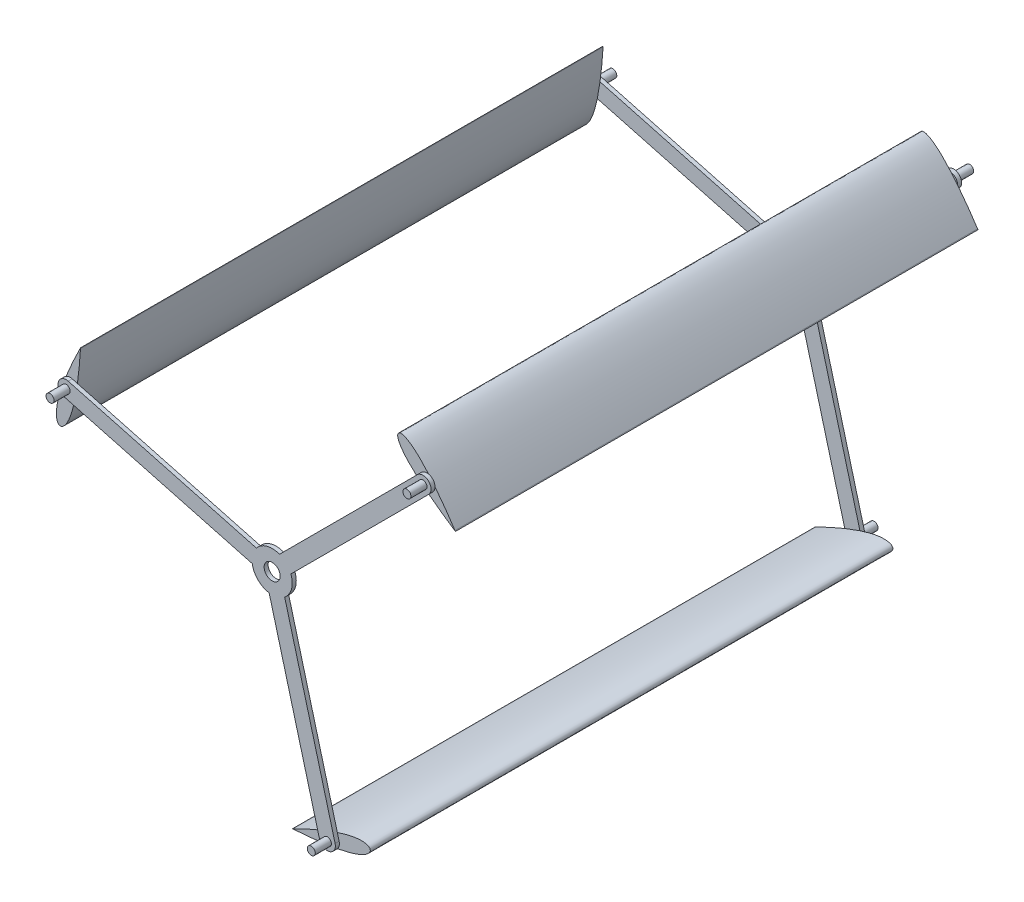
ISO-10303-21;
HEADER;
FILE_DESCRIPTION(('STEP AP214'),'2;1');
FILE_NAME('part.step','',(''),(''),'','','');
FILE_SCHEMA(('AUTOMOTIVE_DESIGN { 1 0 10303 214 1 1 1 1 }'));
ENDSEC;
DATA;
#1=APPLICATION_CONTEXT('core data for automotive mechanical design processes');
#2=APPLICATION_PROTOCOL_DEFINITION('international standard','automotive_design',2000,#1);
#3=PRODUCT_CONTEXT('',#1,'mechanical');
#4=PRODUCT('Part','Part','',(#3));
#5=PRODUCT_RELATED_PRODUCT_CATEGORY('part','',(#4));
#6=PRODUCT_DEFINITION_FORMATION('','',#4);
#7=PRODUCT_DEFINITION_CONTEXT('part definition',#1,'design');
#8=PRODUCT_DEFINITION('design','',#6,#7);
#9=PRODUCT_DEFINITION_SHAPE('','',#8);
#10=(LENGTH_UNIT() NAMED_UNIT(*) SI_UNIT(.MILLI.,.METRE.));
#11=(NAMED_UNIT(*) PLANE_ANGLE_UNIT() SI_UNIT($,.RADIAN.));
#12=(NAMED_UNIT(*) SI_UNIT($,.STERADIAN.) SOLID_ANGLE_UNIT());
#13=UNCERTAINTY_MEASURE_WITH_UNIT(LENGTH_MEASURE(1.E-05),#10,'distance_accuracy_value','');
#14=(GEOMETRIC_REPRESENTATION_CONTEXT(3) GLOBAL_UNCERTAINTY_ASSIGNED_CONTEXT((#13)) GLOBAL_UNIT_ASSIGNED_CONTEXT((#10,
#11,#12)) REPRESENTATION_CONTEXT('',''));
#15=CARTESIAN_POINT('',(0.,0.,0.));
#16=DIRECTION('',(0.,0.,1.));
#17=DIRECTION('',(1.,0.,0.));
#18=AXIS2_PLACEMENT_3D('',#15,#16,#17);
#19=CARTESIAN_POINT('',(152.261291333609,222.971969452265,650.));
#20=DIRECTION('',(0.,0.,-1.));
#21=DIRECTION('',(-1.,0.,0.));
#22=AXIS2_PLACEMENT_3D('',#19,#20,#21);
#23=PLANE('',#22);
#24=CARTESIAN_POINT('',(187.616630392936,187.616630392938,650.));
#25=DIRECTION('',(0.,0.,-1.));
#26=DIRECTION('',(-1.,0.,0.));
#27=AXIS2_PLACEMENT_3D('',#24,#25,#26);
#28=CIRCLE('',#27,10.);
#29=CARTESIAN_POINT('',(197.616630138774,187.614375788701,650.));
#30=VERTEX_POINT('',#29);
#31=CARTESIAN_POINT('',(194.687698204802,180.545562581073,650.));
#32=VERTEX_POINT('',#31);
#33=EDGE_CURVE('E403',#30,#32,#28,.T.);
#34=ORIENTED_EDGE('',*,*,#33,.T.);
#35=DIRECTION('',(-0.707106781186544,-0.707106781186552,0.));
#36=VECTOR('',#35,1.);
#37=CARTESIAN_POINT('',(23.2729195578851,9.1307839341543,650.));
#38=LINE('',#37,#36);
#39=CARTESIAN_POINT('',(189.939025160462,175.796889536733,650.));
#40=VERTEX_POINT('',#39);
#41=EDGE_CURVE('E400',#32,#40,#38,.T.);
#42=ORIENTED_EDGE('',*,*,#41,.T.);
#43=CARTESIAN_POINT('',(222.463797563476,153.034328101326,650.));
#44=CARTESIAN_POINT('',(221.537840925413,154.44290370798,650.));
#45=CARTESIAN_POINT('',(219.688009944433,157.256887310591,650.));
#46=CARTESIAN_POINT('',(215.914326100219,162.819399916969,650.));
#47=CARTESIAN_POINT('',(211.107514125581,169.683248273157,650.));
#48=CARTESIAN_POINT('',(205.194442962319,177.78600178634,650.));
#49=CARTESIAN_POINT('',(199.13784740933,185.743065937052,650.));
#50=CARTESIAN_POINT('',(192.90808877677,193.527158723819,650.));
#51=CARTESIAN_POINT('',(186.450288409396,201.086583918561,650.));
#52=CARTESIAN_POINT('',(180.79855953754,207.129616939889,650.));
#53=CARTESIAN_POINT('',(176.045354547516,211.726648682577,650.));
#54=CARTESIAN_POINT('',(172.328379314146,215.028028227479,650.));
#55=CARTESIAN_POINT('',(168.411412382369,218.142610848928,650.));
#56=CARTESIAN_POINT('',(164.924624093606,220.508144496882,650.));
#57=CARTESIAN_POINT('',(161.923966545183,222.175241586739,650.));
#58=CARTESIAN_POINT('',(159.46803994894,223.283870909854,650.));
#59=CARTESIAN_POINT('',(157.163981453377,223.965510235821,650.));
#60=CARTESIAN_POINT('',(154.668778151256,224.216709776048,650.));
#61=CARTESIAN_POINT('',(151.881912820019,223.351347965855,650.));
#62=CARTESIAN_POINT('',(151.016551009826,220.564482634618,650.));
#63=CARTESIAN_POINT('',(151.267750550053,218.069279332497,650.));
#64=CARTESIAN_POINT('',(151.94938987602,215.765220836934,650.));
#65=CARTESIAN_POINT('',(153.058019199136,213.309294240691,650.));
#66=CARTESIAN_POINT('',(154.725116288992,210.308636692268,650.));
#67=CARTESIAN_POINT('',(157.090649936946,206.821848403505,650.));
#68=CARTESIAN_POINT('',(160.205232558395,202.904881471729,650.));
#69=CARTESIAN_POINT('',(163.506612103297,199.187906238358,650.));
#70=CARTESIAN_POINT('',(168.103643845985,194.434701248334,650.));
#71=CARTESIAN_POINT('',(174.146676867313,188.782972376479,650.));
#72=CARTESIAN_POINT('',(181.706102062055,182.325172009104,650.));
#73=CARTESIAN_POINT('',(189.490194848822,176.095413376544,650.));
#74=CARTESIAN_POINT('',(197.447258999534,170.038817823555,650.));
#75=CARTESIAN_POINT('',(205.550012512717,164.125746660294,650.));
#76=CARTESIAN_POINT('',(212.413860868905,159.318934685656,650.));
#77=CARTESIAN_POINT('',(217.976373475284,155.545250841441,650.));
#78=CARTESIAN_POINT('',(220.790357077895,153.695419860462,650.));
#79=CARTESIAN_POINT('',(222.198932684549,152.769463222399,650.));
#80=B_SPLINE_CURVE_WITH_KNOTS('',3,(#43,#44,#45,#46,#47,#48,#49,#50,#51,#52,#53,#54,#55,#56,#57,
#58,#59,#60,#61,#62,#63,#64,#65,#66,#67,#68,#69,#70,#71,#72,#73,#74,#75,#76,#77,#78,#79),
.UNSPECIFIED.,.F.,.F.,(4,1,1,1,1,1,1,1,1,1,1,1,1,1,1,1,1,1,1,1,1,1,1,1,1,1,1,1,1,1,1,1,1,1,4),
(0.,0.0246038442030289,0.0491523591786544,0.0981086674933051,0.146905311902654,
0.195554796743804,0.244056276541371,0.292409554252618,0.340643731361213,0.364754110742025,
0.388905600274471,0.413178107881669,0.437756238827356,0.450304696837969,0.463229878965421,
0.477067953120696,0.485035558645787,0.5,0.514964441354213,0.522932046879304,0.536770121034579,
0.549695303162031,0.562243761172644,0.586821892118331,0.611094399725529,0.635245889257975,
0.659356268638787,0.707590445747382,0.755943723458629,0.804445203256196,0.853094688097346,
0.901891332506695,0.950847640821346,0.975396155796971,1.),.UNSPECIFIED.);
#81=CARTESIAN_POINT('',(222.198932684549,152.769463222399,650.));
#82=VERTEX_POINT('',#81);
#83=EDGE_CURVE('E719',#40,#82,#80,.T.);
#84=ORIENTED_EDGE('',*,*,#83,.T.);
#85=DIRECTION('',(0.8356180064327,-0.549310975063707,0.));
#86=VECTOR('',#85,1.);
#87=CARTESIAN_POINT('',(222.198932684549,152.769463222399,650.));
#88=LINE('',#87,#86);
#89=CARTESIAN_POINT('',(222.971969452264,152.261291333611,650.));
#90=VERTEX_POINT('',#89);
#91=EDGE_CURVE('E717',#82,#90,#88,.T.);
#92=ORIENTED_EDGE('',*,*,#91,.T.);
#93=DIRECTION('',(-0.54931097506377,0.835618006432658,0.));
#94=VECTOR('',#93,1.);
#95=CARTESIAN_POINT('',(222.463797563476,153.034328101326,650.));
#96=LINE('',#95,#94);
#97=CARTESIAN_POINT('',(222.463797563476,153.034328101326,650.));
#98=VERTEX_POINT('',#97);
#99=EDGE_CURVE('E724',#90,#98,#96,.T.);
#100=ORIENTED_EDGE('',*,*,#99,.T.);
#101=EDGE_CURVE('E711',#98,#30,#80,.T.);
#102=ORIENTED_EDGE('',*,*,#101,.T.);
#103=EDGE_LOOP('',(#34,#42,#84,#92,#100,#102));
#104=FACE_BOUND('',#103,.T.);
#105=ADVANCED_FACE('F33',(#104),#23,.F.);
#106=CARTESIAN_POINT('',(116.968744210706,-243.348131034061,650.));
#107=DIRECTION('',(0.,0.,-1.));
#108=DIRECTION('',(-1.,0.,0.));
#109=AXIS2_PLACEMENT_3D('',#106,#107,#108);
#110=PLANE('',#109);
#111=CARTESIAN_POINT('',(68.6724528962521,-256.289083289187,650.));
#112=DIRECTION('',(0.,0.,-1.));
#113=DIRECTION('',(1.,0.,0.));
#114=AXIS2_PLACEMENT_3D('',#111,#112,#113);
#115=CIRCLE('',#114,10.);
#116=CARTESIAN_POINT('',(63.6705004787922,-264.948209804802,650.));
#117=VERTEX_POINT('',#116);
#118=CARTESIAN_POINT('',(59.0131946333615,-258.877273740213,650.));
#119=VERTEX_POINT('',#118);
#120=EDGE_CURVE('E59',#117,#119,#115,.T.);
#121=ORIENTED_EDGE('',*,*,#120,.T.);
#122=DIRECTION('',(-0.258819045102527,0.965925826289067,0.));
#123=VECTOR('',#122,1.);
#124=CARTESIAN_POINT('',(-3.72896893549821,-24.7203315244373,650.));
#125=LINE('',#124,#123);
#126=CARTESIAN_POINT('',(57.2750596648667,-252.390465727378,650.));
#127=VERTEX_POINT('',#126);
#128=EDGE_CURVE('E387',#119,#127,#125,.T.);
#129=ORIENTED_EDGE('',*,*,#128,.T.);
#130=CARTESIAN_POINT('',(21.2997170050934,-269.176464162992,650.));
#131=CARTESIAN_POINT('',(22.9825575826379,-269.078849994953,650.));
#132=CARTESIAN_POINT('',(26.3444543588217,-268.883841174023,650.));
#133=CARTESIAN_POINT('',(33.0485735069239,-268.396991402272,650.));
#134=CARTESIAN_POINT('',(41.3962465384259,-267.666094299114,650.));
#135=CARTESIAN_POINT('',(51.3699725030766,-266.596601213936,650.));
#136=CARTESIAN_POINT('',(61.2892899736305,-265.329967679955,650.));
#137=CARTESIAN_POINT('',(71.1453913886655,-263.826884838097,650.));
#138=CARTESIAN_POINT('',(80.9209458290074,-262.013978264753,650.));
#139=CARTESIAN_POINT('',(88.9802303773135,-260.140953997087,650.));
#140=CARTESIAN_POINT('',(95.3379791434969,-258.323073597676,650.));
#141=CARTESIAN_POINT('',(100.055545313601,-256.75476839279,650.));
#142=CARTESIAN_POINT('',(104.71133645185,-254.919866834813,650.));
#143=CARTESIAN_POINT('',(108.503342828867,-253.082986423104,650.));
#144=CARTESIAN_POINT('',(111.447420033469,-251.31788930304,650.));
#145=CARTESIAN_POINT('',(113.635484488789,-249.745309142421,650.));
#146=CARTESIAN_POINT('',(115.377830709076,-248.090755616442,650.));
#147=CARTESIAN_POINT('',(116.842977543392,-246.055445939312,650.));
#148=CARTESIAN_POINT('',(117.486984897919,-243.209268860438,650.));
#149=CARTESIAN_POINT('',(115.506169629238,-241.066410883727,650.));
#150=CARTESIAN_POINT('',(113.219660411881,-240.036354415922,650.));
#151=CARTESIAN_POINT('',(110.883467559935,-239.474642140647,650.));
#152=CARTESIAN_POINT('',(108.2022580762,-239.206779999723,650.));
#153=CARTESIAN_POINT('',(104.77006386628,-239.150199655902,650.));
#154=CARTESIAN_POINT('',(100.567649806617,-239.455417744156,650.));
#155=CARTESIAN_POINT('',(95.6181656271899,-240.194241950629,650.));
#156=CARTESIAN_POINT('',(90.7484808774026,-241.194832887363,650.));
#157=CARTESIAN_POINT('',(84.3335687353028,-242.799376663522,650.));
#158=CARTESIAN_POINT('',(76.41751144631,-245.206932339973,650.));
#159=CARTESIAN_POINT('',(67.0451796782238,-248.52468641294,650.));
#160=CARTESIAN_POINT('',(57.7580040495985,-252.151029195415,650.));
#161=CARTESIAN_POINT('',(48.5343063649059,-256.01375111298,650.));
#162=CARTESIAN_POINT('',(39.3620597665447,-260.074405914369,650.));
#163=CARTESIAN_POINT('',(31.767314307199,-263.615266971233,650.));
#164=CARTESIAN_POINT('',(25.7179519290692,-266.545702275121,650.));
#165=CARTESIAN_POINT('',(22.708959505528,-268.057768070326,650.));
#166=CARTESIAN_POINT('',(21.2027697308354,-268.814652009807,650.));
#167=B_SPLINE_CURVE_WITH_KNOTS('',3,(#130,#131,#132,#133,#134,#135,#136,#137,#138,#139,#140,
#141,#142,#143,#144,#145,#146,#147,#148,#149,#150,#151,#152,#153,#154,#155,#156,#157,#158,#159,
#160,#161,#162,#163,#164,#165,#166),.UNSPECIFIED.,.F.,.F.,(4,1,1,1,1,1,1,1,1,1,1,1,1,1,1,1,1,1,
1,1,1,1,1,1,1,1,1,1,1,1,1,1,1,1,4),(0.,0.0246038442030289,0.0491523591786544,0.0981086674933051,
0.146905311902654,0.195554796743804,0.244056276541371,0.292409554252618,0.340643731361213,
0.364754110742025,0.388905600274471,0.413178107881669,0.437756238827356,0.450304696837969,
0.463229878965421,0.477067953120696,0.485035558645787,0.5,0.514964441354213,0.522932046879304,
0.536770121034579,0.549695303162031,0.562243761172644,0.586821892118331,0.611094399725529,
0.635245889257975,0.659356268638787,0.707590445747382,0.755943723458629,0.804445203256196,
0.853094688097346,0.901891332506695,0.950847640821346,0.975396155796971,1.),.UNSPECIFIED.);
#168=CARTESIAN_POINT('',(21.2027697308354,-268.814652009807,650.));
#169=VERTEX_POINT('',#168);
#170=EDGE_CURVE('E549',#127,#169,#167,.T.);
#171=ORIENTED_EDGE('',*,*,#170,.T.);
#172=DIRECTION('',(-0.893526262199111,-0.449010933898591,0.));
#173=VECTOR('',#172,1.);
#174=CARTESIAN_POINT('',(21.2027697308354,-268.814652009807,650.));
#175=LINE('',#174,#173);
#176=CARTESIAN_POINT('',(20.3761615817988,-269.230035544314,650.));
#177=VERTEX_POINT('',#176);
#178=EDGE_CURVE('E547',#169,#177,#175,.T.);
#179=ORIENTED_EDGE('',*,*,#178,.T.);
#180=DIRECTION('',(0.998321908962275,0.0579082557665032,0.));
#181=VECTOR('',#180,1.);
#182=CARTESIAN_POINT('',(21.2997170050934,-269.176464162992,650.));
#183=LINE('',#182,#181);
#184=CARTESIAN_POINT('',(21.2997170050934,-269.176464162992,650.));
#185=VERTEX_POINT('',#184);
#186=EDGE_CURVE('E556',#177,#185,#183,.T.);
#187=ORIENTED_EDGE('',*,*,#186,.T.);
#188=EDGE_CURVE('E541',#185,#117,#167,.T.);
#189=ORIENTED_EDGE('',*,*,#188,.T.);
#190=EDGE_LOOP('',(#121,#129,#171,#179,#187,#189));
#191=FACE_BOUND('',#190,.T.);
#192=ADVANCED_FACE('F522',(#191),#110,.F.);
#193=CARTESIAN_POINT('',(-269.230035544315,20.3761615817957,650.));
#194=DIRECTION('',(0.,0.,-1.));
#195=DIRECTION('',(-1.,0.,0.));
#196=AXIS2_PLACEMENT_3D('',#193,#194,#195);
#197=PLANE('',#196);
#198=CARTESIAN_POINT('',(-256.289083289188,68.6724528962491,650.));
#199=DIRECTION('',(0.,0.,-1.));
#200=DIRECTION('',(1.,0.,0.));
#201=AXIS2_PLACEMENT_3D('',#198,#199,#200);
#202=CIRCLE('',#201,10.);
#203=CARTESIAN_POINT('',(-261.287130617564,77.3338340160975,650.));
#204=VERTEX_POINT('',#203);
#205=CARTESIAN_POINT('',(-253.700892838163,78.3317111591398,650.));
#206=VERTEX_POINT('',#205);
#207=EDGE_CURVE('E417',#204,#206,#202,.T.);
#208=ORIENTED_EDGE('',*,*,#207,.T.);
#209=DIRECTION('',(0.96592582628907,-0.258819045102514,0.));
#210=VECTOR('',#209,1.);
#211=CARTESIAN_POINT('',(-19.5439506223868,15.5895475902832,650.));
#212=LINE('',#211,#210);
#213=CARTESIAN_POINT('',(-247.214084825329,76.5935761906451,650.));
#214=VERTEX_POINT('',#213);
#215=EDGE_CURVE('E414',#206,#214,#212,.T.);
#216=ORIENTED_EDGE('',*,*,#215,.T.);
#217=CARTESIAN_POINT('',(-243.76351456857,116.142136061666,650.));
#218=CARTESIAN_POINT('',(-244.520398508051,114.635946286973,650.));
#219=CARTESIAN_POINT('',(-246.032464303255,111.626953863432,650.));
#220=CARTESIAN_POINT('',(-248.962899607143,105.577591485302,650.));
#221=CARTESIAN_POINT('',(-252.503760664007,97.9828460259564,650.));
#222=CARTESIAN_POINT('',(-256.564415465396,88.8105994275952,650.));
#223=CARTESIAN_POINT('',(-260.427137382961,79.5869017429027,650.));
#224=CARTESIAN_POINT('',(-264.053480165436,70.2997261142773,650.));
#225=CARTESIAN_POINT('',(-267.371234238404,60.9273943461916,650.));
#226=CARTESIAN_POINT('',(-269.778789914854,53.0113370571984,650.));
#227=CARTESIAN_POINT('',(-271.383333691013,46.5964249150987,650.));
#228=CARTESIAN_POINT('',(-272.383924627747,41.7267401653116,650.));
#229=CARTESIAN_POINT('',(-273.12274883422,36.7772559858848,650.));
#230=CARTESIAN_POINT('',(-273.427966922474,32.5748419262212,650.));
#231=CARTESIAN_POINT('',(-273.371386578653,29.1426477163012,650.));
#232=CARTESIAN_POINT('',(-273.103524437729,26.4614382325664,650.));
#233=CARTESIAN_POINT('',(-272.541812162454,24.1252453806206,650.));
#234=CARTESIAN_POINT('',(-271.511755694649,21.8387361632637,650.));
#235=CARTESIAN_POINT('',(-269.368897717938,19.8579208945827,650.));
#236=CARTESIAN_POINT('',(-266.522720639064,20.5019282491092,650.));
#237=CARTESIAN_POINT('',(-264.487410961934,21.967075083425,650.));
#238=CARTESIAN_POINT('',(-262.832857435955,23.709421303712,650.));
#239=CARTESIAN_POINT('',(-261.260277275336,25.8974857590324,650.));
#240=CARTESIAN_POINT('',(-259.495180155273,28.8415629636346,650.));
#241=CARTESIAN_POINT('',(-257.658299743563,32.6335693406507,650.));
#242=CARTESIAN_POINT('',(-255.823398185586,37.2893604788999,650.));
#243=CARTESIAN_POINT('',(-254.2550929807,42.0069266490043,650.));
#244=CARTESIAN_POINT('',(-252.437212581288,48.3646754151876,650.));
#245=CARTESIAN_POINT('',(-250.564188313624,56.4239599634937,650.));
#246=CARTESIAN_POINT('',(-248.751281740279,66.1995144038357,650.));
#247=CARTESIAN_POINT('',(-247.248198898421,76.0556158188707,650.));
#248=CARTESIAN_POINT('',(-245.981565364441,85.9749332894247,650.));
#249=CARTESIAN_POINT('',(-244.912072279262,95.9486592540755,650.));
#250=CARTESIAN_POINT('',(-244.181175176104,104.296332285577,650.));
#251=CARTESIAN_POINT('',(-243.694325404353,111.000451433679,650.));
#252=CARTESIAN_POINT('',(-243.499316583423,114.362348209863,650.));
#253=CARTESIAN_POINT('',(-243.401702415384,116.045188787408,650.));
#254=B_SPLINE_CURVE_WITH_KNOTS('',3,(#217,#218,#219,#220,#221,#222,#223,#224,#225,#226,#227,
#228,#229,#230,#231,#232,#233,#234,#235,#236,#237,#238,#239,#240,#241,#242,#243,#244,#245,#246,
#247,#248,#249,#250,#251,#252,#253),.UNSPECIFIED.,.F.,.F.,(4,1,1,1,1,1,1,1,1,1,1,1,1,1,1,1,1,1,
1,1,1,1,1,1,1,1,1,1,1,1,1,1,1,1,4),(0.,0.0246038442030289,0.0491523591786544,0.0981086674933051,
0.146905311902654,0.195554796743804,0.244056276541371,0.292409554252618,0.340643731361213,
0.364754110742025,0.388905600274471,0.413178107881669,0.437756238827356,0.450304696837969,
0.463229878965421,0.477067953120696,0.485035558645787,0.5,0.514964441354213,0.522932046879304,
0.536770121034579,0.549695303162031,0.562243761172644,0.586821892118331,0.611094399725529,
0.635245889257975,0.659356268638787,0.707590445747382,0.755943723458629,0.804445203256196,
0.853094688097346,0.901891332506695,0.950847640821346,0.975396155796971,1.),.UNSPECIFIED.);
#255=CARTESIAN_POINT('',(-243.401702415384,116.045188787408,650.));
#256=VERTEX_POINT('',#255);
#257=EDGE_CURVE('E486',#214,#256,#254,.T.);
#258=ORIENTED_EDGE('',*,*,#257,.T.);
#259=DIRECTION('',(0.0579082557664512,0.998321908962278,0.));
#260=VECTOR('',#259,1.);
#261=CARTESIAN_POINT('',(-243.401702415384,116.045188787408,650.));
#262=LINE('',#261,#260);
#263=CARTESIAN_POINT('',(-243.348131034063,116.968744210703,650.));
#264=VERTEX_POINT('',#263);
#265=EDGE_CURVE('E484',#256,#264,#262,.T.);
#266=ORIENTED_EDGE('',*,*,#265,.T.);
#267=DIRECTION('',(-0.449010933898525,-0.893526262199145,0.));
#268=VECTOR('',#267,1.);
#269=CARTESIAN_POINT('',(-243.76351456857,116.142136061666,650.));
#270=LINE('',#269,#268);
#271=CARTESIAN_POINT('',(-243.76351456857,116.142136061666,650.));
#272=VERTEX_POINT('',#271);
#273=EDGE_CURVE('E1059',#264,#272,#270,.T.);
#274=ORIENTED_EDGE('',*,*,#273,.T.);
#275=EDGE_CURVE('E478',#272,#204,#254,.T.);
#276=ORIENTED_EDGE('',*,*,#275,.T.);
#277=EDGE_LOOP('',(#208,#216,#258,#266,#274,#276));
#278=FACE_BOUND('',#277,.T.);
#279=ADVANCED_FACE('F904',(#278),#197,.F.);
#280=CARTESIAN_POINT('',(0.,0.,0.));
#281=DIRECTION('',(0.,0.,-1.));
#282=DIRECTION('',(-1.,0.,0.));
#283=AXIS2_PLACEMENT_3D('',#280,#281,#282);
#284=PLANE('',#283);
#285=CARTESIAN_POINT('',(-243.76351456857,116.142136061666,0.));
#286=CARTESIAN_POINT('',(-244.520398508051,114.635946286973,0.));
#287=CARTESIAN_POINT('',(-246.032464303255,111.626953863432,0.));
#288=CARTESIAN_POINT('',(-248.962899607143,105.577591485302,0.));
#289=CARTESIAN_POINT('',(-252.503760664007,97.9828460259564,0.));
#290=CARTESIAN_POINT('',(-256.564415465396,88.8105994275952,0.));
#291=CARTESIAN_POINT('',(-260.427137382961,79.5869017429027,0.));
#292=CARTESIAN_POINT('',(-264.053480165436,70.2997261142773,0.));
#293=CARTESIAN_POINT('',(-267.371234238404,60.9273943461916,0.));
#294=CARTESIAN_POINT('',(-269.778789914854,53.0113370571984,0.));
#295=CARTESIAN_POINT('',(-271.383333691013,46.5964249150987,0.));
#296=CARTESIAN_POINT('',(-272.383924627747,41.7267401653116,0.));
#297=CARTESIAN_POINT('',(-273.12274883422,36.7772559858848,0.));
#298=CARTESIAN_POINT('',(-273.427966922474,32.5748419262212,0.));
#299=CARTESIAN_POINT('',(-273.371386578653,29.1426477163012,0.));
#300=CARTESIAN_POINT('',(-273.103524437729,26.4614382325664,0.));
#301=CARTESIAN_POINT('',(-272.541812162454,24.1252453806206,0.));
#302=CARTESIAN_POINT('',(-271.511755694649,21.8387361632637,0.));
#303=CARTESIAN_POINT('',(-269.368897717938,19.8579208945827,0.));
#304=CARTESIAN_POINT('',(-266.522720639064,20.5019282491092,0.));
#305=CARTESIAN_POINT('',(-264.487410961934,21.967075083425,0.));
#306=CARTESIAN_POINT('',(-262.832857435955,23.709421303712,0.));
#307=CARTESIAN_POINT('',(-261.260277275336,25.8974857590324,0.));
#308=CARTESIAN_POINT('',(-259.495180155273,28.8415629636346,0.));
#309=CARTESIAN_POINT('',(-257.658299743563,32.6335693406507,0.));
#310=CARTESIAN_POINT('',(-255.823398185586,37.2893604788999,0.));
#311=CARTESIAN_POINT('',(-254.2550929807,42.0069266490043,0.));
#312=CARTESIAN_POINT('',(-252.437212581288,48.3646754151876,0.));
#313=CARTESIAN_POINT('',(-250.564188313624,56.4239599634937,0.));
#314=CARTESIAN_POINT('',(-248.751281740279,66.1995144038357,0.));
#315=CARTESIAN_POINT('',(-247.248198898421,76.0556158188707,0.));
#316=CARTESIAN_POINT('',(-245.981565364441,85.9749332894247,0.));
#317=CARTESIAN_POINT('',(-244.912072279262,95.9486592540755,0.));
#318=CARTESIAN_POINT('',(-244.181175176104,104.296332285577,0.));
#319=CARTESIAN_POINT('',(-243.694325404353,111.000451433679,0.));
#320=CARTESIAN_POINT('',(-243.499316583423,114.362348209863,0.));
#321=CARTESIAN_POINT('',(-243.401702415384,116.045188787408,0.));
#322=B_SPLINE_CURVE_WITH_KNOTS('',3,(#285,#286,#287,#288,#289,#290,#291,#292,#293,#294,#295,
#296,#297,#298,#299,#300,#301,#302,#303,#304,#305,#306,#307,#308,#309,#310,#311,#312,#313,#314,
#315,#316,#317,#318,#319,#320,#321),.UNSPECIFIED.,.F.,.F.,(4,1,1,1,1,1,1,1,1,1,1,1,1,1,1,1,1,1,
1,1,1,1,1,1,1,1,1,1,1,1,1,1,1,1,4),(0.,0.0246038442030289,0.0491523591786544,0.0981086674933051,
0.146905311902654,0.195554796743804,0.244056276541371,0.292409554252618,0.340643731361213,
0.364754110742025,0.388905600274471,0.413178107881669,0.437756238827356,0.450304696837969,
0.463229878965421,0.477067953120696,0.485035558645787,0.5,0.514964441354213,0.522932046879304,
0.536770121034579,0.549695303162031,0.562243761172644,0.586821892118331,0.611094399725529,
0.635245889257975,0.659356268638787,0.707590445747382,0.755943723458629,0.804445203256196,
0.853094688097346,0.901891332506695,0.950847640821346,0.975396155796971,1.),.UNSPECIFIED.);
#323=CARTESIAN_POINT('',(-261.287130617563,77.333834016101,0.));
#324=VERTEX_POINT('',#323);
#325=CARTESIAN_POINT('',(-265.754348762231,65.4461935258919,0.));
#326=VERTEX_POINT('',#325);
#327=EDGE_CURVE('E1061',#324,#326,#322,.T.);
#328=ORIENTED_EDGE('',*,*,#327,.F.);
#329=CARTESIAN_POINT('',(-256.289083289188,68.6724528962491,0.));
#330=DIRECTION('',(0.,0.,-1.));
#331=DIRECTION('',(1.,0.,0.));
#332=AXIS2_PLACEMENT_3D('',#329,#330,#331);
#333=CIRCLE('',#332,10.);
#334=EDGE_CURVE('E627',#326,#324,#333,.T.);
#335=ORIENTED_EDGE('',*,*,#334,.F.);
#336=EDGE_LOOP('',(#328,#335));
#337=FACE_BOUND('',#336,.T.);
#338=ADVANCED_FACE('F925',(#337),#284,.F.);
#339=CARTESIAN_POINT('',(21.2997170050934,-269.176464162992,0.));
#340=CARTESIAN_POINT('',(22.9825575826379,-269.078849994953,0.));
#341=CARTESIAN_POINT('',(26.3444543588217,-268.883841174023,0.));
#342=CARTESIAN_POINT('',(33.0485735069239,-268.396991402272,0.));
#343=CARTESIAN_POINT('',(41.3962465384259,-267.666094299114,0.));
#344=CARTESIAN_POINT('',(51.3699725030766,-266.596601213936,0.));
#345=CARTESIAN_POINT('',(61.2892899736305,-265.329967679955,0.));
#346=CARTESIAN_POINT('',(71.1453913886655,-263.826884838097,0.));
#347=CARTESIAN_POINT('',(80.9209458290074,-262.013978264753,0.));
#348=CARTESIAN_POINT('',(88.9802303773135,-260.140953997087,0.));
#349=CARTESIAN_POINT('',(95.3379791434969,-258.323073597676,0.));
#350=CARTESIAN_POINT('',(100.055545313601,-256.75476839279,0.));
#351=CARTESIAN_POINT('',(104.71133645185,-254.919866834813,0.));
#352=CARTESIAN_POINT('',(108.503342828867,-253.082986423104,0.));
#353=CARTESIAN_POINT('',(111.447420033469,-251.31788930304,0.));
#354=CARTESIAN_POINT('',(113.635484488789,-249.745309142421,0.));
#355=CARTESIAN_POINT('',(115.377830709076,-248.090755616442,0.));
#356=CARTESIAN_POINT('',(116.842977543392,-246.055445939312,0.));
#357=CARTESIAN_POINT('',(117.486984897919,-243.209268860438,0.));
#358=CARTESIAN_POINT('',(115.506169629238,-241.066410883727,0.));
#359=CARTESIAN_POINT('',(113.219660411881,-240.036354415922,0.));
#360=CARTESIAN_POINT('',(110.883467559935,-239.474642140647,0.));
#361=CARTESIAN_POINT('',(108.2022580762,-239.206779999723,0.));
#362=CARTESIAN_POINT('',(104.77006386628,-239.150199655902,0.));
#363=CARTESIAN_POINT('',(100.567649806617,-239.455417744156,0.));
#364=CARTESIAN_POINT('',(95.6181656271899,-240.194241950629,0.));
#365=CARTESIAN_POINT('',(90.7484808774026,-241.194832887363,0.));
#366=CARTESIAN_POINT('',(84.3335687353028,-242.799376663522,0.));
#367=CARTESIAN_POINT('',(76.41751144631,-245.206932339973,0.));
#368=CARTESIAN_POINT('',(67.0451796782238,-248.52468641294,0.));
#369=CARTESIAN_POINT('',(57.7580040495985,-252.151029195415,0.));
#370=CARTESIAN_POINT('',(48.5343063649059,-256.01375111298,0.));
#371=CARTESIAN_POINT('',(39.3620597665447,-260.074405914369,0.));
#372=CARTESIAN_POINT('',(31.767314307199,-263.615266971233,0.));
#373=CARTESIAN_POINT('',(25.7179519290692,-266.545702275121,0.));
#374=CARTESIAN_POINT('',(22.708959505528,-268.057768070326,0.));
#375=CARTESIAN_POINT('',(21.2027697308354,-268.814652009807,0.));
#376=B_SPLINE_CURVE_WITH_KNOTS('',3,(#339,#340,#341,#342,#343,#344,#345,#346,#347,#348,#349,
#350,#351,#352,#353,#354,#355,#356,#357,#358,#359,#360,#361,#362,#363,#364,#365,#366,#367,#368,
#369,#370,#371,#372,#373,#374,#375),.UNSPECIFIED.,.F.,.F.,(4,1,1,1,1,1,1,1,1,1,1,1,1,1,1,1,1,1,
1,1,1,1,1,1,1,1,1,1,1,1,1,1,1,1,4),(0.,0.0246038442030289,0.0491523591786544,0.0981086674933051,
0.146905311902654,0.195554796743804,0.244056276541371,0.292409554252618,0.340643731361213,
0.364754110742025,0.388905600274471,0.413178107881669,0.437756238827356,0.450304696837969,
0.463229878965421,0.477067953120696,0.485035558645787,0.5,0.514964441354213,0.522932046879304,
0.536770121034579,0.549695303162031,0.562243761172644,0.586821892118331,0.611094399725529,
0.635245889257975,0.659356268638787,0.707590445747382,0.755943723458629,0.804445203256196,
0.853094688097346,0.901891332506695,0.950847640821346,0.975396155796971,1.),.UNSPECIFIED.);
#377=CARTESIAN_POINT('',(63.6705004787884,-264.948209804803,0.));
#378=VERTEX_POINT('',#377);
#379=CARTESIAN_POINT('',(76.199108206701,-262.873113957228,0.));
#380=VERTEX_POINT('',#379);
#381=EDGE_CURVE('E565',#378,#380,#376,.T.);
#382=ORIENTED_EDGE('',*,*,#381,.F.);
#383=CARTESIAN_POINT('',(68.6724528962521,-256.289083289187,0.));
#384=DIRECTION('',(0.,0.,-1.));
#385=DIRECTION('',(1.,0.,0.));
#386=AXIS2_PLACEMENT_3D('',#383,#384,#385);
#387=CIRCLE('',#386,10.);
#388=EDGE_CURVE('E655',#380,#378,#387,.T.);
#389=ORIENTED_EDGE('',*,*,#388,.F.);
#390=EDGE_LOOP('',(#382,#389));
#391=FACE_BOUND('',#390,.T.);
#392=ADVANCED_FACE('F778',(#391),#284,.F.);
#393=CARTESIAN_POINT('',(152.261291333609,222.971969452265,0.));
#394=DIRECTION('',(0.,0.,-1.));
#395=DIRECTION('',(-1.,0.,0.));
#396=AXIS2_PLACEMENT_3D('',#393,#394,#395);
#397=PLANE('',#396);
#398=CARTESIAN_POINT('',(187.616630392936,187.616630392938,0.));
#399=DIRECTION('',(0.,0.,-1.));
#400=DIRECTION('',(-1.,0.,0.));
#401=AXIS2_PLACEMENT_3D('',#398,#399,#400);
#402=CIRCLE('',#401,10.);
#403=CARTESIAN_POINT('',(180.545562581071,194.687698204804,0.));
#404=VERTEX_POINT('',#403);
#405=CARTESIAN_POINT('',(189.55524055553,197.426920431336,0.));
#406=VERTEX_POINT('',#405);
#407=EDGE_CURVE('E642',#404,#406,#402,.T.);
#408=ORIENTED_EDGE('',*,*,#407,.F.);
#409=DIRECTION('',(0.707106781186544,0.707106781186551,0.));
#410=VECTOR('',#409,1.);
#411=CARTESIAN_POINT('',(9.13078393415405,23.2729195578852,0.));
#412=LINE('',#411,#410);
#413=CARTESIAN_POINT('',(174.460513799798,188.602649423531,0.));
#414=VERTEX_POINT('',#413);
#415=EDGE_CURVE('E637',#414,#404,#412,.T.);
#416=ORIENTED_EDGE('',*,*,#415,.F.);
#417=CARTESIAN_POINT('',(222.463797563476,153.034328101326,0.));
#418=CARTESIAN_POINT('',(221.537840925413,154.44290370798,0.));
#419=CARTESIAN_POINT('',(219.688009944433,157.256887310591,0.));
#420=CARTESIAN_POINT('',(215.914326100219,162.819399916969,0.));
#421=CARTESIAN_POINT('',(211.107514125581,169.683248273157,0.));
#422=CARTESIAN_POINT('',(205.194442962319,177.78600178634,0.));
#423=CARTESIAN_POINT('',(199.13784740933,185.743065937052,0.));
#424=CARTESIAN_POINT('',(192.90808877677,193.527158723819,0.));
#425=CARTESIAN_POINT('',(186.450288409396,201.086583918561,0.));
#426=CARTESIAN_POINT('',(180.79855953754,207.129616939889,0.));
#427=CARTESIAN_POINT('',(176.045354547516,211.726648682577,0.));
#428=CARTESIAN_POINT('',(172.328379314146,215.028028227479,0.));
#429=CARTESIAN_POINT('',(168.411412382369,218.142610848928,0.));
#430=CARTESIAN_POINT('',(164.924624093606,220.508144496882,0.));
#431=CARTESIAN_POINT('',(161.923966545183,222.175241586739,0.));
#432=CARTESIAN_POINT('',(159.46803994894,223.283870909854,0.));
#433=CARTESIAN_POINT('',(157.163981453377,223.965510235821,0.));
#434=CARTESIAN_POINT('',(154.668778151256,224.216709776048,0.));
#435=CARTESIAN_POINT('',(151.881912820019,223.351347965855,0.));
#436=CARTESIAN_POINT('',(151.016551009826,220.564482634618,0.));
#437=CARTESIAN_POINT('',(151.267750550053,218.069279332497,0.));
#438=CARTESIAN_POINT('',(151.94938987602,215.765220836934,0.));
#439=CARTESIAN_POINT('',(153.058019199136,213.309294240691,0.));
#440=CARTESIAN_POINT('',(154.725116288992,210.308636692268,0.));
#441=CARTESIAN_POINT('',(157.090649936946,206.821848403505,0.));
#442=CARTESIAN_POINT('',(160.205232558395,202.904881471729,0.));
#443=CARTESIAN_POINT('',(163.506612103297,199.187906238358,0.));
#444=CARTESIAN_POINT('',(168.103643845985,194.434701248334,0.));
#445=CARTESIAN_POINT('',(174.146676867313,188.782972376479,0.));
#446=CARTESIAN_POINT('',(181.706102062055,182.325172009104,0.));
#447=CARTESIAN_POINT('',(189.490194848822,176.095413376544,0.));
#448=CARTESIAN_POINT('',(197.447258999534,170.038817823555,0.));
#449=CARTESIAN_POINT('',(205.550012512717,164.125746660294,0.));
#450=CARTESIAN_POINT('',(212.413860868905,159.318934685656,0.));
#451=CARTESIAN_POINT('',(217.976373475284,155.545250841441,0.));
#452=CARTESIAN_POINT('',(220.790357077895,153.695419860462,0.));
#453=CARTESIAN_POINT('',(222.198932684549,152.769463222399,0.));
#454=B_SPLINE_CURVE_WITH_KNOTS('',3,(#417,#418,#419,#420,#421,#422,#423,#424,#425,#426,#427,
#428,#429,#430,#431,#432,#433,#434,#435,#436,#437,#438,#439,#440,#441,#442,#443,#444,#445,#446,
#447,#448,#449,#450,#451,#452,#453),.UNSPECIFIED.,.F.,.F.,(4,1,1,1,1,1,1,1,1,1,1,1,1,1,1,1,1,1,
1,1,1,1,1,1,1,1,1,1,1,1,1,1,1,1,4),(0.,0.0246038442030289,0.0491523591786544,0.0981086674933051,
0.146905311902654,0.195554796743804,0.244056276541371,0.292409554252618,0.340643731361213,
0.364754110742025,0.388905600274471,0.413178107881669,0.437756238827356,0.450304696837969,
0.463229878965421,0.477067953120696,0.485035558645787,0.5,0.514964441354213,0.522932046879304,
0.536770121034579,0.549695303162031,0.562243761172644,0.586821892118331,0.611094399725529,
0.635245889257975,0.659356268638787,0.707590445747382,0.755943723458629,0.804445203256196,
0.853094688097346,0.901891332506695,0.950847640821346,0.975396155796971,1.),.UNSPECIFIED.);
#455=EDGE_CURVE('E733',#406,#414,#454,.T.);
#456=ORIENTED_EDGE('',*,*,#455,.F.);
#457=EDGE_LOOP('',(#408,#416,#456));
#458=FACE_BOUND('',#457,.T.);
#459=ADVANCED_FACE('F829',(#458),#397,.T.);
#460=DIRECTION('',(-0.707106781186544,-0.707106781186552,0.));
#461=VECTOR('',#460,1.);
#462=CARTESIAN_POINT('',(23.2729195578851,9.1307839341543,0.));
#463=LINE('',#462,#461);
#464=CARTESIAN_POINT('',(194.687698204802,180.545562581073,0.));
#465=VERTEX_POINT('',#464);
#466=CARTESIAN_POINT('',(189.939025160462,175.796889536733,0.));
#467=VERTEX_POINT('',#466);
#468=EDGE_CURVE('E647',#465,#467,#463,.T.);
#469=ORIENTED_EDGE('',*,*,#468,.F.);
#470=CARTESIAN_POINT('',(197.616630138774,187.614375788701,0.));
#471=VERTEX_POINT('',#470);
#472=EDGE_CURVE('E641',#471,#465,#402,.T.);
#473=ORIENTED_EDGE('',*,*,#472,.F.);
#474=CARTESIAN_POINT('',(222.463797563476,153.034328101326,0.));
#475=VERTEX_POINT('',#474);
#476=EDGE_CURVE('E727',#475,#471,#454,.T.);
#477=ORIENTED_EDGE('',*,*,#476,.F.);
#478=DIRECTION('',(-0.54931097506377,0.835618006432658,0.));
#479=VECTOR('',#478,1.);
#480=CARTESIAN_POINT('',(222.463797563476,153.034328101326,0.));
#481=LINE('',#480,#479);
#482=CARTESIAN_POINT('',(222.971969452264,152.261291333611,0.));
#483=VERTEX_POINT('',#482);
#484=EDGE_CURVE('E738',#483,#475,#481,.T.);
#485=ORIENTED_EDGE('',*,*,#484,.F.);
#486=DIRECTION('',(0.8356180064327,-0.549310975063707,0.));
#487=VECTOR('',#486,1.);
#488=CARTESIAN_POINT('',(222.198932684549,152.769463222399,0.));
#489=LINE('',#488,#487);
#490=CARTESIAN_POINT('',(222.198932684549,152.769463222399,0.));
#491=VERTEX_POINT('',#490);
#492=EDGE_CURVE('E732',#491,#483,#489,.T.);
#493=ORIENTED_EDGE('',*,*,#492,.F.);
#494=EDGE_CURVE('E707',#467,#491,#454,.T.);
#495=ORIENTED_EDGE('',*,*,#494,.F.);
#496=EDGE_LOOP('',(#469,#473,#477,#485,#493,#495));
#497=FACE_BOUND('',#496,.T.);
#498=ADVANCED_FACE('F836',(#497),#397,.T.);
#499=DIRECTION('',(0.,0.,-1.));
#500=VECTOR('',#499,1.);
#501=SURFACE_OF_LINEAR_EXTRUSION('',#80,#500);
#502=ORIENTED_EDGE('',*,*,#476,.T.);
#503=CARTESIAN_POINT('',(222.463797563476,153.034328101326,1.11022302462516E-13));
#504=CARTESIAN_POINT('',(221.537840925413,154.44290370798,1.11022302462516E-13));
#505=CARTESIAN_POINT('',(219.688009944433,157.256887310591,1.11022302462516E-13));
#506=CARTESIAN_POINT('',(215.914326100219,162.819399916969,1.11022302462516E-13));
#507=CARTESIAN_POINT('',(211.107514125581,169.683248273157,1.11022302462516E-13));
#508=CARTESIAN_POINT('',(205.194442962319,177.78600178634,1.11022302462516E-13));
#509=CARTESIAN_POINT('',(199.13784740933,185.743065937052,1.11022302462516E-13));
#510=CARTESIAN_POINT('',(192.90808877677,193.527158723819,1.11022302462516E-13));
#511=CARTESIAN_POINT('',(186.450288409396,201.086583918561,1.11022302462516E-13));
#512=CARTESIAN_POINT('',(180.79855953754,207.129616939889,1.11022302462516E-13));
#513=CARTESIAN_POINT('',(176.045354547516,211.726648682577,1.11022302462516E-13));
#514=CARTESIAN_POINT('',(172.328379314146,215.028028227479,1.11022302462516E-13));
#515=CARTESIAN_POINT('',(168.411412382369,218.142610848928,1.11022302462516E-13));
#516=CARTESIAN_POINT('',(164.924624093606,220.508144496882,1.11022302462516E-13));
#517=CARTESIAN_POINT('',(161.923966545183,222.175241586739,1.11022302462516E-13));
#518=CARTESIAN_POINT('',(159.46803994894,223.283870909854,1.11022302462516E-13));
#519=CARTESIAN_POINT('',(157.163981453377,223.965510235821,1.11022302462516E-13));
#520=CARTESIAN_POINT('',(154.668778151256,224.216709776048,1.11022302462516E-13));
#521=CARTESIAN_POINT('',(151.881912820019,223.351347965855,1.11022302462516E-13));
#522=CARTESIAN_POINT('',(151.016551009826,220.564482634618,1.11022302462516E-13));
#523=CARTESIAN_POINT('',(151.267750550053,218.069279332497,1.11022302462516E-13));
#524=CARTESIAN_POINT('',(151.94938987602,215.765220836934,1.11022302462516E-13));
#525=CARTESIAN_POINT('',(153.058019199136,213.309294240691,1.11022302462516E-13));
#526=CARTESIAN_POINT('',(154.725116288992,210.308636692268,1.11022302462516E-13));
#527=CARTESIAN_POINT('',(157.090649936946,206.821848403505,1.11022302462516E-13));
#528=CARTESIAN_POINT('',(160.205232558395,202.904881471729,1.11022302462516E-13));
#529=CARTESIAN_POINT('',(163.506612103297,199.187906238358,1.11022302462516E-13));
#530=CARTESIAN_POINT('',(168.103643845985,194.434701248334,1.11022302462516E-13));
#531=CARTESIAN_POINT('',(174.146676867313,188.782972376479,1.11022302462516E-13));
#532=CARTESIAN_POINT('',(181.706102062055,182.325172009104,1.11022302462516E-13));
#533=CARTESIAN_POINT('',(189.490194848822,176.095413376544,1.11022302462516E-13));
#534=CARTESIAN_POINT('',(197.447258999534,170.038817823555,1.11022302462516E-13));
#535=CARTESIAN_POINT('',(205.550012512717,164.125746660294,1.11022302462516E-13));
#536=CARTESIAN_POINT('',(212.413860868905,159.318934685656,1.11022302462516E-13));
#537=CARTESIAN_POINT('',(217.976373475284,155.545250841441,1.11022302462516E-13));
#538=CARTESIAN_POINT('',(220.790357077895,153.695419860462,1.11022302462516E-13));
#539=CARTESIAN_POINT('',(222.198932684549,152.769463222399,1.11022302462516E-13));
#540=B_SPLINE_CURVE_WITH_KNOTS('',3,(#503,#504,#505,#506,#507,#508,#509,#510,#511,#512,#513,
#514,#515,#516,#517,#518,#519,#520,#521,#522,#523,#524,#525,#526,#527,#528,#529,#530,#531,#532,
#533,#534,#535,#536,#537,#538,#539),.UNSPECIFIED.,.F.,.F.,(4,1,1,1,1,1,1,1,1,1,1,1,1,1,1,1,1,1,
1,1,1,1,1,1,1,1,1,1,1,1,1,1,1,1,4),(0.,0.0246038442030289,0.0491523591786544,0.0981086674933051,
0.146905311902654,0.195554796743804,0.244056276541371,0.292409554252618,0.340643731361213,
0.364754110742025,0.388905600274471,0.413178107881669,0.437756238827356,0.450304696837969,
0.463229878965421,0.477067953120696,0.485035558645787,0.5,0.514964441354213,0.522932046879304,
0.536770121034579,0.549695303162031,0.562243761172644,0.586821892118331,0.611094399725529,
0.635245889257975,0.659356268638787,0.707590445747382,0.755943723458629,0.804445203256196,
0.853094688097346,0.901891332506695,0.950847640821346,0.975396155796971,1.),.UNSPECIFIED.);
#541=EDGE_CURVE('E696',#406,#471,#540,.F.);
#542=ORIENTED_EDGE('',*,*,#541,.F.);
#543=ORIENTED_EDGE('',*,*,#455,.T.);
#544=EDGE_CURVE('E700',#467,#414,#540,.F.);
#545=ORIENTED_EDGE('',*,*,#544,.F.);
#546=ORIENTED_EDGE('',*,*,#494,.T.);
#547=DIRECTION('',(0.,0.,-1.));
#548=VECTOR('',#547,1.);
#549=CARTESIAN_POINT('',(222.198932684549,152.769463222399,650.));
#550=LINE('',#549,#548);
#551=EDGE_CURVE('E11',#82,#491,#550,.T.);
#552=ORIENTED_EDGE('',*,*,#551,.F.);
#553=ORIENTED_EDGE('',*,*,#83,.F.);
#554=CARTESIAN_POINT('',(222.463797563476,153.034328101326,650.));
#555=CARTESIAN_POINT('',(221.537840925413,154.44290370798,650.));
#556=CARTESIAN_POINT('',(219.688009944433,157.256887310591,650.));
#557=CARTESIAN_POINT('',(215.914326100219,162.819399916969,650.));
#558=CARTESIAN_POINT('',(211.107514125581,169.683248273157,650.));
#559=CARTESIAN_POINT('',(205.194442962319,177.78600178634,650.));
#560=CARTESIAN_POINT('',(199.13784740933,185.743065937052,650.));
#561=CARTESIAN_POINT('',(192.90808877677,193.527158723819,650.));
#562=CARTESIAN_POINT('',(186.450288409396,201.086583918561,650.));
#563=CARTESIAN_POINT('',(180.79855953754,207.129616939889,650.));
#564=CARTESIAN_POINT('',(176.045354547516,211.726648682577,650.));
#565=CARTESIAN_POINT('',(172.328379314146,215.028028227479,650.));
#566=CARTESIAN_POINT('',(168.411412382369,218.142610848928,650.));
#567=CARTESIAN_POINT('',(164.924624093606,220.508144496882,650.));
#568=CARTESIAN_POINT('',(161.923966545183,222.175241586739,650.));
#569=CARTESIAN_POINT('',(159.46803994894,223.283870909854,650.));
#570=CARTESIAN_POINT('',(157.163981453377,223.965510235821,650.));
#571=CARTESIAN_POINT('',(154.668778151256,224.216709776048,650.));
#572=CARTESIAN_POINT('',(151.881912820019,223.351347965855,650.));
#573=CARTESIAN_POINT('',(151.016551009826,220.564482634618,650.));
#574=CARTESIAN_POINT('',(151.267750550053,218.069279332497,650.));
#575=CARTESIAN_POINT('',(151.94938987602,215.765220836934,650.));
#576=CARTESIAN_POINT('',(153.058019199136,213.309294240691,650.));
#577=CARTESIAN_POINT('',(154.725116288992,210.308636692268,650.));
#578=CARTESIAN_POINT('',(157.090649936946,206.821848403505,650.));
#579=CARTESIAN_POINT('',(160.205232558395,202.904881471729,650.));
#580=CARTESIAN_POINT('',(163.506612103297,199.187906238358,650.));
#581=CARTESIAN_POINT('',(168.103643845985,194.434701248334,650.));
#582=CARTESIAN_POINT('',(174.146676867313,188.782972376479,650.));
#583=CARTESIAN_POINT('',(181.706102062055,182.325172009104,650.));
#584=CARTESIAN_POINT('',(189.490194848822,176.095413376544,650.));
#585=CARTESIAN_POINT('',(197.447258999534,170.038817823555,650.));
#586=CARTESIAN_POINT('',(205.550012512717,164.125746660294,650.));
#587=CARTESIAN_POINT('',(212.413860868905,159.318934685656,650.));
#588=CARTESIAN_POINT('',(217.976373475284,155.545250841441,650.));
#589=CARTESIAN_POINT('',(220.790357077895,153.695419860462,650.));
#590=CARTESIAN_POINT('',(222.198932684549,152.769463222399,650.));
#591=B_SPLINE_CURVE_WITH_KNOTS('',3,(#554,#555,#556,#557,#558,#559,#560,#561,#562,#563,#564,
#565,#566,#567,#568,#569,#570,#571,#572,#573,#574,#575,#576,#577,#578,#579,#580,#581,#582,#583,
#584,#585,#586,#587,#588,#589,#590),.UNSPECIFIED.,.F.,.F.,(4,1,1,1,1,1,1,1,1,1,1,1,1,1,1,1,1,1,
1,1,1,1,1,1,1,1,1,1,1,1,1,1,1,1,4),(0.,0.0246038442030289,0.0491523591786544,0.0981086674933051,
0.146905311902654,0.195554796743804,0.244056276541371,0.292409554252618,0.340643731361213,
0.364754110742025,0.388905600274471,0.413178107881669,0.437756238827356,0.450304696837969,
0.463229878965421,0.477067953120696,0.485035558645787,0.5,0.514964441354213,0.522932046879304,
0.536770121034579,0.549695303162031,0.562243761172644,0.586821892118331,0.611094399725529,
0.635245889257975,0.659356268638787,0.707590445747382,0.755943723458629,0.804445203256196,
0.853094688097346,0.901891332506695,0.950847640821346,0.975396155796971,1.),.UNSPECIFIED.);
#592=CARTESIAN_POINT('',(174.460513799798,188.602649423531,650.));
#593=VERTEX_POINT('',#592);
#594=EDGE_CURVE('E454',#593,#40,#591,.T.);
#595=ORIENTED_EDGE('',*,*,#594,.F.);
#596=CARTESIAN_POINT('',(189.55524055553,197.426920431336,650.));
#597=VERTEX_POINT('',#596);
#598=EDGE_CURVE('E718',#597,#593,#80,.T.);
#599=ORIENTED_EDGE('',*,*,#598,.F.);
#600=EDGE_CURVE('E461',#30,#597,#591,.T.);
#601=ORIENTED_EDGE('',*,*,#600,.F.);
#602=ORIENTED_EDGE('',*,*,#101,.F.);
#603=DIRECTION('',(0.,0.,-1.));
#604=VECTOR('',#603,1.);
#605=CARTESIAN_POINT('',(222.463797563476,153.034328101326,650.));
#606=LINE('',#605,#604);
#607=EDGE_CURVE('E726',#98,#475,#606,.T.);
#608=ORIENTED_EDGE('',*,*,#607,.T.);
#609=EDGE_LOOP('',(#502,#542,#543,#545,#546,#552,#553,#595,#599,#601,#602,#608));
#610=FACE_BOUND('',#609,.T.);
#611=ADVANCED_FACE('F35',(#610),#501,.F.);
#612=CARTESIAN_POINT('',(222.198932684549,152.769463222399,650.));
#613=DIRECTION('',(0.549310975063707,0.8356180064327,0.));
#614=DIRECTION('',(-0.8356180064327,0.549310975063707,0.));
#615=AXIS2_PLACEMENT_3D('',#612,#613,#614);
#616=PLANE('',#615);
#617=ORIENTED_EDGE('',*,*,#492,.T.);
#618=DIRECTION('',(0.,0.,-1.));
#619=VECTOR('',#618,1.);
#620=CARTESIAN_POINT('',(222.971969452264,152.261291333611,650.));
#621=LINE('',#620,#619);
#622=EDGE_CURVE('E43',#90,#483,#621,.T.);
#623=ORIENTED_EDGE('',*,*,#622,.F.);
#624=ORIENTED_EDGE('',*,*,#91,.F.);
#625=ORIENTED_EDGE('',*,*,#551,.T.);
#626=EDGE_LOOP('',(#617,#623,#624,#625));
#627=FACE_BOUND('',#626,.T.);
#628=ADVANCED_FACE('F841',(#627),#616,.F.);
#629=CARTESIAN_POINT('',(222.463797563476,153.034328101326,650.));
#630=DIRECTION('',(-0.835618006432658,-0.54931097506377,0.));
#631=DIRECTION('',(0.549310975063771,-0.835618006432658,0.));
#632=AXIS2_PLACEMENT_3D('',#629,#630,#631);
#633=PLANE('',#632);
#634=ORIENTED_EDGE('',*,*,#484,.T.);
#635=ORIENTED_EDGE('',*,*,#607,.F.);
#636=ORIENTED_EDGE('',*,*,#99,.F.);
#637=ORIENTED_EDGE('',*,*,#622,.T.);
#638=EDGE_LOOP('',(#634,#635,#636,#637));
#639=FACE_BOUND('',#638,.T.);
#640=ADVANCED_FACE('F908',(#639),#633,.F.);
#641=DIRECTION('',(0.707106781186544,0.707106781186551,0.));
#642=VECTOR('',#641,1.);
#643=CARTESIAN_POINT('',(9.13078393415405,23.2729195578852,650.));
#644=LINE('',#643,#642);
#645=CARTESIAN_POINT('',(180.545562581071,194.687698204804,650.));
#646=VERTEX_POINT('',#645);
#647=EDGE_CURVE('E405',#593,#646,#644,.T.);
#648=ORIENTED_EDGE('',*,*,#647,.T.);
#649=EDGE_CURVE('E51',#646,#597,#28,.T.);
#650=ORIENTED_EDGE('',*,*,#649,.T.);
#651=ORIENTED_EDGE('',*,*,#598,.T.);
#652=EDGE_LOOP('',(#648,#650,#651));
#653=FACE_BOUND('',#652,.T.);
#654=ADVANCED_FACE('F852',(#653),#23,.F.);
#655=CARTESIAN_POINT('',(-250.564942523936,56.7859121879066,0.));
#656=VERTEX_POINT('',#655);
#657=CARTESIAN_POINT('',(-247.214084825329,76.5935761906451,0.));
#658=VERTEX_POINT('',#657);
#659=EDGE_CURVE('E1067',#656,#658,#322,.T.);
#660=ORIENTED_EDGE('',*,*,#659,.F.);
#661=DIRECTION('',(-0.96592582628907,0.258819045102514,0.));
#662=VECTOR('',#661,1.);
#663=CARTESIAN_POINT('',(-24.7203315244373,-3.72896893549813,0.));
#664=LINE('',#663,#662);
#665=CARTESIAN_POINT('',(-24.7203315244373,-3.72896893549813,0.));
#666=VERTEX_POINT('',#665);
#667=EDGE_CURVE('E624',#666,#656,#664,.T.);
#668=ORIENTED_EDGE('',*,*,#667,.F.);
#669=CARTESIAN_POINT('',(0.,0.,0.));
#670=DIRECTION('',(0.,0.,-1.));
#671=DIRECTION('',(-1.,0.,0.));
#672=AXIS2_PLACEMENT_3D('',#669,#670,#671);
#673=CIRCLE('',#672,25.);
#674=CARTESIAN_POINT('',(-3.72896893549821,-24.7203315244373,0.));
#675=VERTEX_POINT('',#674);
#676=EDGE_CURVE('E591',#675,#666,#673,.T.);
#677=ORIENTED_EDGE('',*,*,#676,.F.);
#678=DIRECTION('',(-0.258819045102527,0.965925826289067,0.));
#679=VECTOR('',#678,1.);
#680=CARTESIAN_POINT('',(-3.72896893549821,-24.7203315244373,0.));
#681=LINE('',#680,#679);
#682=CARTESIAN_POINT('',(57.2750596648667,-252.390465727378,0.));
#683=VERTEX_POINT('',#682);
#684=EDGE_CURVE('E659',#683,#675,#681,.T.);
#685=ORIENTED_EDGE('',*,*,#684,.F.);
#686=CARTESIAN_POINT('',(76.1044287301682,-245.388561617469,0.));
#687=VERTEX_POINT('',#686);
#688=EDGE_CURVE('E765',#687,#683,#376,.T.);
#689=ORIENTED_EDGE('',*,*,#688,.F.);
#690=DIRECTION('',(0.258819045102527,-0.965925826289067,0.));
#691=VECTOR('',#690,1.);
#692=CARTESIAN_POINT('',(15.5895475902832,-19.5439506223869,0.));
#693=LINE('',#692,#691);
#694=CARTESIAN_POINT('',(15.5895475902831,-19.5439506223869,0.));
#695=VERTEX_POINT('',#694);
#696=EDGE_CURVE('E652',#695,#687,#693,.T.);
#697=ORIENTED_EDGE('',*,*,#696,.F.);
#698=CARTESIAN_POINT('',(0.,0.,0.));
#699=DIRECTION('',(0.,0.,-1.));
#700=DIRECTION('',(-1.,0.,0.));
#701=AXIS2_PLACEMENT_3D('',#698,#699,#700);
#702=CIRCLE('',#701,25.);
#703=CARTESIAN_POINT('',(23.2729195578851,9.1307839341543,0.));
#704=VERTEX_POINT('',#703);
#705=EDGE_CURVE('E650',#704,#695,#702,.T.);
#706=ORIENTED_EDGE('',*,*,#705,.F.);
#707=EDGE_CURVE('E645',#467,#704,#463,.T.);
#708=ORIENTED_EDGE('',*,*,#707,.F.);
#709=ORIENTED_EDGE('',*,*,#544,.T.);
#710=CARTESIAN_POINT('',(9.13078393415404,23.2729195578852,0.));
#711=VERTEX_POINT('',#710);
#712=EDGE_CURVE('E638',#711,#414,#412,.T.);
#713=ORIENTED_EDGE('',*,*,#712,.F.);
#714=CARTESIAN_POINT('',(0.,0.,0.));
#715=DIRECTION('',(0.,0.,-1.));
#716=DIRECTION('',(-1.,0.,0.));
#717=AXIS2_PLACEMENT_3D('',#714,#715,#716);
#718=CIRCLE('',#717,25.);
#719=CARTESIAN_POINT('',(-19.5439506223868,15.5895475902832,0.));
#720=VERTEX_POINT('',#719);
#721=EDGE_CURVE('E635',#720,#711,#718,.T.);
#722=ORIENTED_EDGE('',*,*,#721,.F.);
#723=DIRECTION('',(0.96592582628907,-0.258819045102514,0.));
#724=VECTOR('',#723,1.);
#725=CARTESIAN_POINT('',(-19.5439506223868,15.5895475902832,0.));
#726=LINE('',#725,#724);
#727=EDGE_CURVE('E631',#658,#720,#726,.T.);
#728=ORIENTED_EDGE('',*,*,#727,.F.);
#729=EDGE_LOOP('',(#660,#668,#677,#685,#689,#697,#706,#708,#709,#713,#722,#728));
#730=FACE_BOUND('',#729,.T.);
#731=CARTESIAN_POINT('',(0.,0.,0.));
#732=DIRECTION('',(0.,0.,-1.));
#733=DIRECTION('',(-1.,0.,0.));
#734=AXIS2_PLACEMENT_3D('',#731,#732,#733);
#735=CIRCLE('',#734,10.);
#736=CARTESIAN_POINT('',(-10.,0.,0.));
#737=VERTEX_POINT('',#736);
#738=EDGE_CURVE('E592',#737,#737,#735,.T.);
#739=ORIENTED_EDGE('',*,*,#738,.T.);
#740=EDGE_LOOP('',(#739));
#741=FACE_BOUND('',#740,.T.);
#742=ADVANCED_FACE('F791',(#730,#741),#284,.F.);
#743=CARTESIAN_POINT('',(0.,0.,-5.));
#744=DIRECTION('',(0.,0.,-1.));
#745=DIRECTION('',(-1.,0.,0.));
#746=AXIS2_PLACEMENT_3D('',#743,#744,#745);
#747=PLANE('',#746);
#748=CARTESIAN_POINT('',(-256.289083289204,68.6724528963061,-5.));
#749=DIRECTION('',(0.,0.,-1.));
#750=DIRECTION('',(-1.,0.,0.));
#751=AXIS2_PLACEMENT_3D('',#748,#749,#750);
#752=CIRCLE('',#751,5.00000000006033);
#753=CARTESIAN_POINT('',(-261.289083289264,68.6724528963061,-5.));
#754=VERTEX_POINT('',#753);
#755=EDGE_CURVE('E747',#754,#754,#752,.F.);
#756=ORIENTED_EDGE('',*,*,#755,.T.);
#757=EDGE_LOOP('',(#756));
#758=FACE_BOUND('',#757,.T.);
#759=CARTESIAN_POINT('',(68.6724528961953,-256.289083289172,-5.));
#760=DIRECTION('',(0.,0.,-1.));
#761=DIRECTION('',(-1.,0.,0.));
#762=AXIS2_PLACEMENT_3D('',#759,#760,#761);
#763=CIRCLE('',#762,5.00000000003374);
#764=CARTESIAN_POINT('',(63.6724528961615,-256.289083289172,-5.));
#765=VERTEX_POINT('',#764);
#766=EDGE_CURVE('E587',#765,#765,#763,.F.);
#767=ORIENTED_EDGE('',*,*,#766,.T.);
#768=EDGE_LOOP('',(#767));
#769=FACE_BOUND('',#768,.T.);
#770=CARTESIAN_POINT('',(187.616630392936,187.616630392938,-5.));
#771=DIRECTION('',(0.,0.,-1.));
#772=DIRECTION('',(-1.,0.,0.));
#773=AXIS2_PLACEMENT_3D('',#770,#771,#772);
#774=CIRCLE('',#773,5.00000000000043);
#775=CARTESIAN_POINT('',(182.616630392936,187.616630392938,-5.));
#776=VERTEX_POINT('',#775);
#777=EDGE_CURVE('E710',#776,#776,#774,.T.);
#778=ORIENTED_EDGE('',*,*,#777,.F.);
#779=EDGE_LOOP('',(#778));
#780=FACE_BOUND('',#779,.T.);
#781=CARTESIAN_POINT('',(0.,0.,-5.));
#782=DIRECTION('',(0.,0.,-1.));
#783=DIRECTION('',(-1.,0.,0.));
#784=AXIS2_PLACEMENT_3D('',#781,#782,#783);
#785=CIRCLE('',#784,25.);
#786=CARTESIAN_POINT('',(-3.72896893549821,-24.7203315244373,-5.));
#787=VERTEX_POINT('',#786);
#788=CARTESIAN_POINT('',(-24.7203315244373,-3.72896893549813,-5.));
#789=VERTEX_POINT('',#788);
#790=EDGE_CURVE('E595',#787,#789,#785,.T.);
#791=ORIENTED_EDGE('',*,*,#790,.T.);
#792=DIRECTION('',(-0.96592582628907,0.258819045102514,0.));
#793=VECTOR('',#792,1.);
#794=CARTESIAN_POINT('',(-24.7203315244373,-3.72896893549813,-5.));
#795=LINE('',#794,#793);
#796=CARTESIAN_POINT('',(-258.877273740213,59.0131946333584,-5.));
#797=VERTEX_POINT('',#796);
#798=EDGE_CURVE('E598',#789,#797,#795,.T.);
#799=ORIENTED_EDGE('',*,*,#798,.T.);
#800=CARTESIAN_POINT('',(-256.289083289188,68.6724528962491,-5.));
#801=DIRECTION('',(0.,0.,-1.));
#802=DIRECTION('',(1.,0.,0.));
#803=AXIS2_PLACEMENT_3D('',#800,#801,#802);
#804=CIRCLE('',#803,10.);
#805=CARTESIAN_POINT('',(-253.700892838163,78.3317111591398,-5.));
#806=VERTEX_POINT('',#805);
#807=EDGE_CURVE('E601',#797,#806,#804,.T.);
#808=ORIENTED_EDGE('',*,*,#807,.T.);
#809=DIRECTION('',(0.96592582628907,-0.258819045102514,0.));
#810=VECTOR('',#809,1.);
#811=CARTESIAN_POINT('',(-19.5439506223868,15.5895475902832,-5.));
#812=LINE('',#811,#810);
#813=CARTESIAN_POINT('',(-19.5439506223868,15.5895475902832,-5.));
#814=VERTEX_POINT('',#813);
#815=EDGE_CURVE('E603',#806,#814,#812,.T.);
#816=ORIENTED_EDGE('',*,*,#815,.T.);
#817=CARTESIAN_POINT('',(0.,0.,-5.));
#818=DIRECTION('',(0.,0.,-1.));
#819=DIRECTION('',(-1.,0.,0.));
#820=AXIS2_PLACEMENT_3D('',#817,#818,#819);
#821=CIRCLE('',#820,25.);
#822=CARTESIAN_POINT('',(9.13078393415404,23.2729195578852,-5.));
#823=VERTEX_POINT('',#822);
#824=EDGE_CURVE('E605',#814,#823,#821,.T.);
#825=ORIENTED_EDGE('',*,*,#824,.T.);
#826=DIRECTION('',(0.707106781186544,0.707106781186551,0.));
#827=VECTOR('',#826,1.);
#828=CARTESIAN_POINT('',(9.13078393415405,23.2729195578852,-5.));
#829=LINE('',#828,#827);
#830=CARTESIAN_POINT('',(180.545562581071,194.687698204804,-5.));
#831=VERTEX_POINT('',#830);
#832=EDGE_CURVE('E607',#823,#831,#829,.T.);
#833=ORIENTED_EDGE('',*,*,#832,.T.);
#834=CARTESIAN_POINT('',(187.616630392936,187.616630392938,-5.));
#835=DIRECTION('',(0.,0.,-1.));
#836=DIRECTION('',(-1.,0.,0.));
#837=AXIS2_PLACEMENT_3D('',#834,#835,#836);
#838=CIRCLE('',#837,10.);
#839=CARTESIAN_POINT('',(194.687698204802,180.545562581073,-5.));
#840=VERTEX_POINT('',#839);
#841=EDGE_CURVE('E609',#831,#840,#838,.T.);
#842=ORIENTED_EDGE('',*,*,#841,.T.);
#843=DIRECTION('',(-0.707106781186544,-0.707106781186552,0.));
#844=VECTOR('',#843,1.);
#845=CARTESIAN_POINT('',(23.2729195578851,9.1307839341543,-5.));
#846=LINE('',#845,#844);
#847=CARTESIAN_POINT('',(23.2729195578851,9.1307839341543,-5.));
#848=VERTEX_POINT('',#847);
#849=EDGE_CURVE('E611',#840,#848,#846,.T.);
#850=ORIENTED_EDGE('',*,*,#849,.T.);
#851=CARTESIAN_POINT('',(0.,0.,-5.));
#852=DIRECTION('',(0.,0.,-1.));
#853=DIRECTION('',(-1.,0.,0.));
#854=AXIS2_PLACEMENT_3D('',#851,#852,#853);
#855=CIRCLE('',#854,25.);
#856=CARTESIAN_POINT('',(15.5895475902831,-19.5439506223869,-5.));
#857=VERTEX_POINT('',#856);
#858=EDGE_CURVE('E613',#848,#857,#855,.T.);
#859=ORIENTED_EDGE('',*,*,#858,.T.);
#860=DIRECTION('',(0.258819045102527,-0.965925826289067,0.));
#861=VECTOR('',#860,1.);
#862=CARTESIAN_POINT('',(15.5895475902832,-19.5439506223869,-5.));
#863=LINE('',#862,#861);
#864=CARTESIAN_POINT('',(78.3317111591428,-253.700892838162,-5.));
#865=VERTEX_POINT('',#864);
#866=EDGE_CURVE('E615',#857,#865,#863,.T.);
#867=ORIENTED_EDGE('',*,*,#866,.T.);
#868=CARTESIAN_POINT('',(68.6724528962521,-256.289083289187,-5.));
#869=DIRECTION('',(0.,0.,-1.));
#870=DIRECTION('',(1.,0.,0.));
#871=AXIS2_PLACEMENT_3D('',#868,#869,#870);
#872=CIRCLE('',#871,10.);
#873=CARTESIAN_POINT('',(59.0131946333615,-258.877273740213,-5.));
#874=VERTEX_POINT('',#873);
#875=EDGE_CURVE('E617',#865,#874,#872,.T.);
#876=ORIENTED_EDGE('',*,*,#875,.T.);
#877=DIRECTION('',(-0.258819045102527,0.965925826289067,0.));
#878=VECTOR('',#877,1.);
#879=CARTESIAN_POINT('',(-3.72896893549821,-24.7203315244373,-5.));
#880=LINE('',#879,#878);
#881=EDGE_CURVE('E619',#874,#787,#880,.T.);
#882=ORIENTED_EDGE('',*,*,#881,.T.);
#883=EDGE_LOOP('',(#791,#799,#808,#816,#825,#833,#842,#850,#859,#867,#876,#882));
#884=FACE_BOUND('',#883,.T.);
#885=CARTESIAN_POINT('',(0.,0.,-5.));
#886=DIRECTION('',(0.,0.,-1.));
#887=DIRECTION('',(-1.,0.,0.));
#888=AXIS2_PLACEMENT_3D('',#885,#886,#887);
#889=CIRCLE('',#888,10.);
#890=CARTESIAN_POINT('',(-10.,0.,-5.));
#891=VERTEX_POINT('',#890);
#892=EDGE_CURVE('E588',#891,#891,#889,.T.);
#893=ORIENTED_EDGE('',*,*,#892,.F.);
#894=EDGE_LOOP('',(#893));
#895=FACE_BOUND('',#894,.T.);
#896=ADVANCED_FACE('F803',(#758,#769,#780,#884,#895),#747,.T.);
#897=EDGE_CURVE('E646',#406,#471,#402,.T.);
#898=ORIENTED_EDGE('',*,*,#897,.F.);
#899=ORIENTED_EDGE('',*,*,#541,.T.);
#900=EDGE_LOOP('',(#898,#899));
#901=FACE_BOUND('',#900,.T.);
#902=ADVANCED_FACE('F914',(#901),#284,.F.);
#903=CARTESIAN_POINT('',(0.,0.,-5.));
#904=DIRECTION('',(0.,0.,1.));
#905=DIRECTION('',(1.,0.,0.));
#906=AXIS2_PLACEMENT_3D('',#903,#904,#905);
#907=CYLINDRICAL_SURFACE('',#906,25.);
#908=ORIENTED_EDGE('',*,*,#676,.T.);
#909=DIRECTION('',(0.,0.,1.));
#910=VECTOR('',#909,1.);
#911=CARTESIAN_POINT('',(-24.7203315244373,-3.72896893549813,-5.));
#912=LINE('',#911,#910);
#913=EDGE_CURVE('E693',#789,#666,#912,.T.);
#914=ORIENTED_EDGE('',*,*,#913,.F.);
#915=ORIENTED_EDGE('',*,*,#790,.F.);
#916=DIRECTION('',(0.,0.,1.));
#917=VECTOR('',#916,1.);
#918=CARTESIAN_POINT('',(-3.72896893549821,-24.7203315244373,-5.));
#919=LINE('',#918,#917);
#920=EDGE_CURVE('E621',#787,#675,#919,.T.);
#921=ORIENTED_EDGE('',*,*,#920,.T.);
#922=EDGE_LOOP('',(#908,#914,#915,#921));
#923=FACE_BOUND('',#922,.T.);
#924=ADVANCED_FACE('F932',(#923),#907,.T.);
#925=CARTESIAN_POINT('',(-24.7203315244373,-3.72896893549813,-5.));
#926=DIRECTION('',(0.258819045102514,0.96592582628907,0.));
#927=DIRECTION('',(-0.96592582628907,0.258819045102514,0.));
#928=AXIS2_PLACEMENT_3D('',#925,#926,#927);
#929=PLANE('',#928);
#930=ORIENTED_EDGE('',*,*,#667,.T.);
#931=DIRECTION('',(-0.96592582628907,0.258819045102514,0.));
#932=VECTOR('',#931,1.);
#933=CARTESIAN_POINT('',(-24.7203315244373,-3.72896893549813,0.));
#934=LINE('',#933,#932);
#935=CARTESIAN_POINT('',(-258.877273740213,59.0131946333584,0.));
#936=VERTEX_POINT('',#935);
#937=EDGE_CURVE('E749',#656,#936,#934,.T.);
#938=ORIENTED_EDGE('',*,*,#937,.T.);
#939=DIRECTION('',(0.,0.,1.));
#940=VECTOR('',#939,1.);
#941=CARTESIAN_POINT('',(-258.877273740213,59.0131946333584,-5.));
#942=LINE('',#941,#940);
#943=EDGE_CURVE('E690',#797,#936,#942,.T.);
#944=ORIENTED_EDGE('',*,*,#943,.F.);
#945=ORIENTED_EDGE('',*,*,#798,.F.);
#946=ORIENTED_EDGE('',*,*,#913,.T.);
#947=EDGE_LOOP('',(#930,#938,#944,#945,#946));
#948=FACE_BOUND('',#947,.T.);
#949=ADVANCED_FACE('F961',(#948),#929,.F.);
#950=CARTESIAN_POINT('',(-256.289083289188,68.6724528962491,-5.));
#951=DIRECTION('',(0.,0.,1.));
#952=DIRECTION('',(1.,0.,0.));
#953=AXIS2_PLACEMENT_3D('',#950,#951,#952);
#954=CYLINDRICAL_SURFACE('',#953,10.);
#955=EDGE_CURVE('E628',#936,#326,#333,.T.);
#956=ORIENTED_EDGE('',*,*,#955,.T.);
#957=ORIENTED_EDGE('',*,*,#334,.T.);
#958=CARTESIAN_POINT('',(-256.289083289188,68.6724528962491,0.));
#959=DIRECTION('',(0.,0.,-1.));
#960=DIRECTION('',(-1.,0.,0.));
#961=AXIS2_PLACEMENT_3D('',#958,#959,#960);
#962=CIRCLE('',#961,10.);
#963=CARTESIAN_POINT('',(-253.700892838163,78.3317111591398,0.));
#964=VERTEX_POINT('',#963);
#965=EDGE_CURVE('E755',#324,#964,#962,.T.);
#966=ORIENTED_EDGE('',*,*,#965,.T.);
#967=DIRECTION('',(0.,0.,1.));
#968=VECTOR('',#967,1.);
#969=CARTESIAN_POINT('',(-253.700892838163,78.3317111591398,-5.));
#970=LINE('',#969,#968);
#971=EDGE_CURVE('E687',#806,#964,#970,.T.);
#972=ORIENTED_EDGE('',*,*,#971,.F.);
#973=ORIENTED_EDGE('',*,*,#807,.F.);
#974=ORIENTED_EDGE('',*,*,#943,.T.);
#975=EDGE_LOOP('',(#956,#957,#966,#972,#973,#974));
#976=FACE_BOUND('',#975,.T.);
#977=ADVANCED_FACE('F957',(#976),#954,.T.);
#978=CARTESIAN_POINT('',(-19.5439506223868,15.5895475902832,-5.));
#979=DIRECTION('',(-0.258819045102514,-0.96592582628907,0.));
#980=DIRECTION('',(0.96592582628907,-0.258819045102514,0.));
#981=AXIS2_PLACEMENT_3D('',#978,#979,#980);
#982=PLANE('',#981);
#983=EDGE_CURVE('E632',#964,#658,#726,.T.);
#984=ORIENTED_EDGE('',*,*,#983,.T.);
#985=ORIENTED_EDGE('',*,*,#727,.T.);
#986=DIRECTION('',(0.,0.,1.));
#987=VECTOR('',#986,1.);
#988=CARTESIAN_POINT('',(-19.5439506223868,15.5895475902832,-5.));
#989=LINE('',#988,#987);
#990=EDGE_CURVE('E684',#814,#720,#989,.T.);
#991=ORIENTED_EDGE('',*,*,#990,.F.);
#992=ORIENTED_EDGE('',*,*,#815,.F.);
#993=ORIENTED_EDGE('',*,*,#971,.T.);
#994=EDGE_LOOP('',(#984,#985,#991,#992,#993));
#995=FACE_BOUND('',#994,.T.);
#996=ADVANCED_FACE('F953',(#995),#982,.F.);
#997=CARTESIAN_POINT('',(0.,0.,-5.));
#998=DIRECTION('',(0.,0.,1.));
#999=DIRECTION('',(1.,0.,0.));
#1000=AXIS2_PLACEMENT_3D('',#997,#998,#999);
#1001=CYLINDRICAL_SURFACE('',#1000,25.);
#1002=ORIENTED_EDGE('',*,*,#721,.T.);
#1003=DIRECTION('',(0.,0.,1.));
#1004=VECTOR('',#1003,1.);
#1005=CARTESIAN_POINT('',(9.13078393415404,23.2729195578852,-5.));
#1006=LINE('',#1005,#1004);
#1007=EDGE_CURVE('E681',#823,#711,#1006,.T.);
#1008=ORIENTED_EDGE('',*,*,#1007,.F.);
#1009=ORIENTED_EDGE('',*,*,#824,.F.);
#1010=ORIENTED_EDGE('',*,*,#990,.T.);
#1011=EDGE_LOOP('',(#1002,#1008,#1009,#1010));
#1012=FACE_BOUND('',#1011,.T.);
#1013=ADVANCED_FACE('F950',(#1012),#1001,.T.);
#1014=CARTESIAN_POINT('',(9.13078393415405,23.2729195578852,-5.));
#1015=DIRECTION('',(0.707106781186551,-0.707106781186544,0.));
#1016=DIRECTION('',(0.707106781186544,0.707106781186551,0.));
#1017=AXIS2_PLACEMENT_3D('',#1014,#1015,#1016);
#1018=PLANE('',#1017);
#1019=ORIENTED_EDGE('',*,*,#712,.T.);
#1020=ORIENTED_EDGE('',*,*,#415,.T.);
#1021=DIRECTION('',(0.,0.,1.));
#1022=VECTOR('',#1021,1.);
#1023=CARTESIAN_POINT('',(180.545562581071,194.687698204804,-5.));
#1024=LINE('',#1023,#1022);
#1025=EDGE_CURVE('E678',#831,#404,#1024,.T.);
#1026=ORIENTED_EDGE('',*,*,#1025,.F.);
#1027=ORIENTED_EDGE('',*,*,#832,.F.);
#1028=ORIENTED_EDGE('',*,*,#1007,.T.);
#1029=EDGE_LOOP('',(#1019,#1020,#1026,#1027,#1028));
#1030=FACE_BOUND('',#1029,.T.);
#1031=ADVANCED_FACE('F822',(#1030),#1018,.F.);
#1032=CARTESIAN_POINT('',(187.616630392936,187.616630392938,-5.));
#1033=DIRECTION('',(0.,0.,1.));
#1034=DIRECTION('',(1.,0.,0.));
#1035=AXIS2_PLACEMENT_3D('',#1032,#1033,#1034);
#1036=CYLINDRICAL_SURFACE('',#1035,10.);
#1037=ORIENTED_EDGE('',*,*,#407,.T.);
#1038=ORIENTED_EDGE('',*,*,#897,.T.);
#1039=ORIENTED_EDGE('',*,*,#472,.T.);
#1040=DIRECTION('',(0.,0.,1.));
#1041=VECTOR('',#1040,1.);
#1042=CARTESIAN_POINT('',(194.687698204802,180.545562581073,-5.));
#1043=LINE('',#1042,#1041);
#1044=EDGE_CURVE('E676',#840,#465,#1043,.T.);
#1045=ORIENTED_EDGE('',*,*,#1044,.F.);
#1046=ORIENTED_EDGE('',*,*,#841,.F.);
#1047=ORIENTED_EDGE('',*,*,#1025,.T.);
#1048=EDGE_LOOP('',(#1037,#1038,#1039,#1045,#1046,#1047));
#1049=FACE_BOUND('',#1048,.T.);
#1050=ADVANCED_FACE('F944',(#1049),#1036,.T.);
#1051=CARTESIAN_POINT('',(23.2729195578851,9.1307839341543,-5.));
#1052=DIRECTION('',(-0.707106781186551,0.707106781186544,0.));
#1053=DIRECTION('',(-0.707106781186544,-0.707106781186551,0.));
#1054=AXIS2_PLACEMENT_3D('',#1051,#1052,#1053);
#1055=PLANE('',#1054);
#1056=ORIENTED_EDGE('',*,*,#468,.T.);
#1057=ORIENTED_EDGE('',*,*,#707,.T.);
#1058=DIRECTION('',(0.,0.,1.));
#1059=VECTOR('',#1058,1.);
#1060=CARTESIAN_POINT('',(23.2729195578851,9.1307839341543,-5.));
#1061=LINE('',#1060,#1059);
#1062=EDGE_CURVE('E673',#848,#704,#1061,.T.);
#1063=ORIENTED_EDGE('',*,*,#1062,.F.);
#1064=ORIENTED_EDGE('',*,*,#849,.F.);
#1065=ORIENTED_EDGE('',*,*,#1044,.T.);
#1066=EDGE_LOOP('',(#1056,#1057,#1063,#1064,#1065));
#1067=FACE_BOUND('',#1066,.T.);
#1068=ADVANCED_FACE('F812',(#1067),#1055,.F.);
#1069=CARTESIAN_POINT('',(0.,0.,-5.));
#1070=DIRECTION('',(0.,0.,1.));
#1071=DIRECTION('',(1.,0.,0.));
#1072=AXIS2_PLACEMENT_3D('',#1069,#1070,#1071);
#1073=CYLINDRICAL_SURFACE('',#1072,25.);
#1074=ORIENTED_EDGE('',*,*,#705,.T.);
#1075=DIRECTION('',(0.,0.,1.));
#1076=VECTOR('',#1075,1.);
#1077=CARTESIAN_POINT('',(15.5895475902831,-19.5439506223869,-5.));
#1078=LINE('',#1077,#1076);
#1079=EDGE_CURVE('E670',#857,#695,#1078,.T.);
#1080=ORIENTED_EDGE('',*,*,#1079,.F.);
#1081=ORIENTED_EDGE('',*,*,#858,.F.);
#1082=ORIENTED_EDGE('',*,*,#1062,.T.);
#1083=EDGE_LOOP('',(#1074,#1080,#1081,#1082));
#1084=FACE_BOUND('',#1083,.T.);
#1085=ADVANCED_FACE('F810',(#1084),#1073,.T.);
#1086=CARTESIAN_POINT('',(15.5895475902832,-19.5439506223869,-5.));
#1087=DIRECTION('',(-0.965925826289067,-0.258819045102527,0.));
#1088=DIRECTION('',(0.258819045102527,-0.965925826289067,0.));
#1089=AXIS2_PLACEMENT_3D('',#1086,#1087,#1088);
#1090=PLANE('',#1089);
#1091=ORIENTED_EDGE('',*,*,#696,.T.);
#1092=DIRECTION('',(0.258819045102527,-0.965925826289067,0.));
#1093=VECTOR('',#1092,1.);
#1094=CARTESIAN_POINT('',(15.5895475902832,-19.5439506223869,0.));
#1095=LINE('',#1094,#1093);
#1096=CARTESIAN_POINT('',(78.3317111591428,-253.700892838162,0.));
#1097=VERTEX_POINT('',#1096);
#1098=EDGE_CURVE('E584',#687,#1097,#1095,.T.);
#1099=ORIENTED_EDGE('',*,*,#1098,.T.);
#1100=DIRECTION('',(0.,0.,1.));
#1101=VECTOR('',#1100,1.);
#1102=CARTESIAN_POINT('',(78.3317111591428,-253.700892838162,-5.));
#1103=LINE('',#1102,#1101);
#1104=EDGE_CURVE('E667',#865,#1097,#1103,.T.);
#1105=ORIENTED_EDGE('',*,*,#1104,.F.);
#1106=ORIENTED_EDGE('',*,*,#866,.F.);
#1107=ORIENTED_EDGE('',*,*,#1079,.T.);
#1108=EDGE_LOOP('',(#1091,#1099,#1105,#1106,#1107));
#1109=FACE_BOUND('',#1108,.T.);
#1110=ADVANCED_FACE('F784',(#1109),#1090,.F.);
#1111=CARTESIAN_POINT('',(68.6724528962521,-256.289083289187,-5.));
#1112=DIRECTION('',(0.,0.,1.));
#1113=DIRECTION('',(1.,0.,0.));
#1114=AXIS2_PLACEMENT_3D('',#1111,#1112,#1113);
#1115=CYLINDRICAL_SURFACE('',#1114,10.);
#1116=EDGE_CURVE('E656',#1097,#380,#387,.T.);
#1117=ORIENTED_EDGE('',*,*,#1116,.T.);
#1118=ORIENTED_EDGE('',*,*,#388,.T.);
#1119=CARTESIAN_POINT('',(68.6724528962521,-256.289083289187,0.));
#1120=DIRECTION('',(0.,0.,-1.));
#1121=DIRECTION('',(-1.,0.,0.));
#1122=AXIS2_PLACEMENT_3D('',#1119,#1120,#1121);
#1123=CIRCLE('',#1122,10.);
#1124=CARTESIAN_POINT('',(59.0131946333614,-258.877273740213,0.));
#1125=VERTEX_POINT('',#1124);
#1126=EDGE_CURVE('E581',#378,#1125,#1123,.T.);
#1127=ORIENTED_EDGE('',*,*,#1126,.T.);
#1128=DIRECTION('',(0.,0.,1.));
#1129=VECTOR('',#1128,1.);
#1130=CARTESIAN_POINT('',(59.0131946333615,-258.877273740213,-5.));
#1131=LINE('',#1130,#1129);
#1132=EDGE_CURVE('E664',#874,#1125,#1131,.T.);
#1133=ORIENTED_EDGE('',*,*,#1132,.F.);
#1134=ORIENTED_EDGE('',*,*,#875,.F.);
#1135=ORIENTED_EDGE('',*,*,#1104,.T.);
#1136=EDGE_LOOP('',(#1117,#1118,#1127,#1133,#1134,#1135));
#1137=FACE_BOUND('',#1136,.T.);
#1138=ADVANCED_FACE('F780',(#1137),#1115,.T.);
#1139=CARTESIAN_POINT('',(-3.72896893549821,-24.7203315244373,-5.));
#1140=DIRECTION('',(0.965925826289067,0.258819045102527,0.));
#1141=DIRECTION('',(-0.258819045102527,0.965925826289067,0.));
#1142=AXIS2_PLACEMENT_3D('',#1139,#1140,#1141);
#1143=PLANE('',#1142);
#1144=EDGE_CURVE('E599',#1125,#683,#681,.T.);
#1145=ORIENTED_EDGE('',*,*,#1144,.T.);
#1146=ORIENTED_EDGE('',*,*,#684,.T.);
#1147=ORIENTED_EDGE('',*,*,#920,.F.);
#1148=ORIENTED_EDGE('',*,*,#881,.F.);
#1149=ORIENTED_EDGE('',*,*,#1132,.T.);
#1150=EDGE_LOOP('',(#1145,#1146,#1147,#1148,#1149));
#1151=FACE_BOUND('',#1150,.T.);
#1152=ADVANCED_FACE('F797',(#1151),#1143,.F.);
#1153=CARTESIAN_POINT('',(0.,0.,-5.));
#1154=DIRECTION('',(0.,0.,1.));
#1155=DIRECTION('',(1.,0.,0.));
#1156=AXIS2_PLACEMENT_3D('',#1153,#1154,#1155);
#1157=CYLINDRICAL_SURFACE('',#1156,10.);
#1158=ORIENTED_EDGE('',*,*,#892,.T.);
#1159=EDGE_LOOP('',(#1158));
#1160=FACE_BOUND('',#1159,.T.);
#1161=ORIENTED_EDGE('',*,*,#738,.F.);
#1162=EDGE_LOOP('',(#1161));
#1163=FACE_BOUND('',#1162,.T.);
#1164=ADVANCED_FACE('F539',(#1160,#1163),#1157,.F.);
#1165=CARTESIAN_POINT('',(187.616630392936,187.616630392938,-24.9999999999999));
#1166=DIRECTION('',(0.,0.,-1.));
#1167=DIRECTION('',(-1.,0.,0.));
#1168=AXIS2_PLACEMENT_3D('',#1165,#1166,#1167);
#1169=PLANE('',#1168);
#1170=CARTESIAN_POINT('',(187.616630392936,187.616630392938,-24.9999999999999));
#1171=DIRECTION('',(0.,0.,-1.));
#1172=DIRECTION('',(-1.,0.,0.));
#1173=AXIS2_PLACEMENT_3D('',#1170,#1171,#1172);
#1174=CIRCLE('',#1173,5.00000000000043);
#1175=CARTESIAN_POINT('',(182.616630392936,187.616630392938,-24.9999999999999));
#1176=VERTEX_POINT('',#1175);
#1177=EDGE_CURVE('E701',#1176,#1176,#1174,.T.);
#1178=ORIENTED_EDGE('',*,*,#1177,.T.);
#1179=EDGE_LOOP('',(#1178));
#1180=FACE_BOUND('',#1179,.T.);
#1181=ADVANCED_FACE('F968',(#1180),#1169,.T.);
#1182=CARTESIAN_POINT('',(187.616630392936,187.616630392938,-24.9999999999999));
#1183=DIRECTION('',(0.,0.,1.));
#1184=DIRECTION('',(1.,0.,0.));
#1185=AXIS2_PLACEMENT_3D('',#1182,#1183,#1184);
#1186=CYLINDRICAL_SURFACE('',#1185,5.00000000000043);
#1187=ORIENTED_EDGE('',*,*,#777,.T.);
#1188=EDGE_LOOP('',(#1187));
#1189=FACE_BOUND('',#1188,.T.);
#1190=ORIENTED_EDGE('',*,*,#1177,.F.);
#1191=EDGE_LOOP('',(#1190));
#1192=FACE_BOUND('',#1191,.T.);
#1193=ADVANCED_FACE('F520',(#1189,#1192),#1186,.T.);
#1194=DIRECTION('',(0.258819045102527,-0.965925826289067,0.));
#1195=VECTOR('',#1194,1.);
#1196=CARTESIAN_POINT('',(15.5895475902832,-19.5439506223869,650.));
#1197=LINE('',#1196,#1195);
#1198=CARTESIAN_POINT('',(76.1044287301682,-245.388561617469,650.));
#1199=VERTEX_POINT('',#1198);
#1200=CARTESIAN_POINT('',(78.3317111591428,-253.700892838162,650.));
#1201=VERTEX_POINT('',#1200);
#1202=EDGE_CURVE('E391',#1199,#1201,#1197,.T.);
#1203=ORIENTED_EDGE('',*,*,#1202,.T.);
#1204=CARTESIAN_POINT('',(76.1991082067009,-262.873113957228,650.));
#1205=VERTEX_POINT('',#1204);
#1206=EDGE_CURVE('E389',#1201,#1205,#115,.T.);
#1207=ORIENTED_EDGE('',*,*,#1206,.T.);
#1208=EDGE_CURVE('E548',#1205,#1199,#167,.T.);
#1209=ORIENTED_EDGE('',*,*,#1208,.T.);
#1210=EDGE_LOOP('',(#1203,#1207,#1209));
#1211=FACE_BOUND('',#1210,.T.);
#1212=ADVANCED_FACE('F516',(#1211),#110,.F.);
#1213=CARTESIAN_POINT('',(21.2997170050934,-269.176464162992,650.));
#1214=DIRECTION('',(-0.0579082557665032,0.998321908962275,0.));
#1215=DIRECTION('',(-0.998321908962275,-0.0579082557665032,0.));
#1216=AXIS2_PLACEMENT_3D('',#1213,#1214,#1215);
#1217=PLANE('',#1216);
#1218=DIRECTION('',(0.998321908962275,0.0579082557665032,0.));
#1219=VECTOR('',#1218,1.);
#1220=CARTESIAN_POINT('',(21.2997170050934,-269.176464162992,0.));
#1221=LINE('',#1220,#1219);
#1222=CARTESIAN_POINT('',(20.3761615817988,-269.230035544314,0.));
#1223=VERTEX_POINT('',#1222);
#1224=CARTESIAN_POINT('',(21.2997170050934,-269.176464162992,0.));
#1225=VERTEX_POINT('',#1224);
#1226=EDGE_CURVE('E571',#1223,#1225,#1221,.T.);
#1227=ORIENTED_EDGE('',*,*,#1226,.T.);
#1228=DIRECTION('',(0.,0.,-1.));
#1229=VECTOR('',#1228,1.);
#1230=CARTESIAN_POINT('',(21.2997170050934,-269.176464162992,650.));
#1231=LINE('',#1230,#1229);
#1232=EDGE_CURVE('E558',#185,#1225,#1231,.T.);
#1233=ORIENTED_EDGE('',*,*,#1232,.F.);
#1234=ORIENTED_EDGE('',*,*,#186,.F.);
#1235=DIRECTION('',(0.,0.,-1.));
#1236=VECTOR('',#1235,1.);
#1237=CARTESIAN_POINT('',(20.3761615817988,-269.230035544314,650.));
#1238=LINE('',#1237,#1236);
#1239=EDGE_CURVE('E575',#177,#1223,#1238,.T.);
#1240=ORIENTED_EDGE('',*,*,#1239,.T.);
#1241=EDGE_LOOP('',(#1227,#1233,#1234,#1240));
#1242=FACE_BOUND('',#1241,.T.);
#1243=ADVANCED_FACE('F519',(#1242),#1217,.F.);
#1244=CARTESIAN_POINT('',(21.2027697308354,-268.814652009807,650.));
#1245=DIRECTION('',(0.449010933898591,-0.893526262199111,0.));
#1246=DIRECTION('',(0.893526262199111,0.449010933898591,0.));
#1247=AXIS2_PLACEMENT_3D('',#1244,#1245,#1246);
#1248=PLANE('',#1247);
#1249=DIRECTION('',(-0.893526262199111,-0.449010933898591,0.));
#1250=VECTOR('',#1249,1.);
#1251=CARTESIAN_POINT('',(21.2027697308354,-268.814652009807,0.));
#1252=LINE('',#1251,#1250);
#1253=CARTESIAN_POINT('',(21.2027697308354,-268.814652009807,0.));
#1254=VERTEX_POINT('',#1253);
#1255=EDGE_CURVE('E564',#1254,#1223,#1252,.T.);
#1256=ORIENTED_EDGE('',*,*,#1255,.T.);
#1257=ORIENTED_EDGE('',*,*,#1239,.F.);
#1258=ORIENTED_EDGE('',*,*,#178,.F.);
#1259=DIRECTION('',(0.,0.,-1.));
#1260=VECTOR('',#1259,1.);
#1261=CARTESIAN_POINT('',(21.2027697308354,-268.814652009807,650.));
#1262=LINE('',#1261,#1260);
#1263=EDGE_CURVE('E578',#169,#1254,#1262,.T.);
#1264=ORIENTED_EDGE('',*,*,#1263,.T.);
#1265=EDGE_LOOP('',(#1256,#1257,#1258,#1264));
#1266=FACE_BOUND('',#1265,.T.);
#1267=ADVANCED_FACE('F529',(#1266),#1248,.F.);
#1268=DIRECTION('',(0.,0.,-1.));
#1269=VECTOR('',#1268,1.);
#1270=SURFACE_OF_LINEAR_EXTRUSION('',#167,#1269);
#1271=EDGE_CURVE('E559',#1225,#378,#376,.T.);
#1272=ORIENTED_EDGE('',*,*,#1271,.T.);
#1273=ORIENTED_EDGE('',*,*,#381,.T.);
#1274=EDGE_CURVE('E769',#380,#687,#376,.T.);
#1275=ORIENTED_EDGE('',*,*,#1274,.T.);
#1276=ORIENTED_EDGE('',*,*,#688,.T.);
#1277=EDGE_CURVE('E566',#683,#1254,#376,.T.);
#1278=ORIENTED_EDGE('',*,*,#1277,.T.);
#1279=ORIENTED_EDGE('',*,*,#1263,.F.);
#1280=ORIENTED_EDGE('',*,*,#170,.F.);
#1281=CARTESIAN_POINT('',(21.2997170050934,-269.176464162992,650.));
#1282=CARTESIAN_POINT('',(22.9825575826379,-269.078849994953,650.));
#1283=CARTESIAN_POINT('',(26.3444543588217,-268.883841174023,650.));
#1284=CARTESIAN_POINT('',(33.0485735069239,-268.396991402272,650.));
#1285=CARTESIAN_POINT('',(41.3962465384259,-267.666094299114,650.));
#1286=CARTESIAN_POINT('',(51.3699725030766,-266.596601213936,650.));
#1287=CARTESIAN_POINT('',(61.2892899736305,-265.329967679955,650.));
#1288=CARTESIAN_POINT('',(71.1453913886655,-263.826884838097,650.));
#1289=CARTESIAN_POINT('',(80.9209458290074,-262.013978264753,650.));
#1290=CARTESIAN_POINT('',(88.9802303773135,-260.140953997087,650.));
#1291=CARTESIAN_POINT('',(95.3379791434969,-258.323073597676,650.));
#1292=CARTESIAN_POINT('',(100.055545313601,-256.75476839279,650.));
#1293=CARTESIAN_POINT('',(104.71133645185,-254.919866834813,650.));
#1294=CARTESIAN_POINT('',(108.503342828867,-253.082986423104,650.));
#1295=CARTESIAN_POINT('',(111.447420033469,-251.31788930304,650.));
#1296=CARTESIAN_POINT('',(113.635484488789,-249.745309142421,650.));
#1297=CARTESIAN_POINT('',(115.377830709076,-248.090755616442,650.));
#1298=CARTESIAN_POINT('',(116.842977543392,-246.055445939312,650.));
#1299=CARTESIAN_POINT('',(117.486984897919,-243.209268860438,650.));
#1300=CARTESIAN_POINT('',(115.506169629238,-241.066410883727,650.));
#1301=CARTESIAN_POINT('',(113.219660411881,-240.036354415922,650.));
#1302=CARTESIAN_POINT('',(110.883467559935,-239.474642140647,650.));
#1303=CARTESIAN_POINT('',(108.2022580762,-239.206779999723,650.));
#1304=CARTESIAN_POINT('',(104.77006386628,-239.150199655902,650.));
#1305=CARTESIAN_POINT('',(100.567649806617,-239.455417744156,650.));
#1306=CARTESIAN_POINT('',(95.6181656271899,-240.194241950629,650.));
#1307=CARTESIAN_POINT('',(90.7484808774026,-241.194832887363,650.));
#1308=CARTESIAN_POINT('',(84.3335687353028,-242.799376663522,650.));
#1309=CARTESIAN_POINT('',(76.41751144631,-245.206932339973,650.));
#1310=CARTESIAN_POINT('',(67.0451796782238,-248.52468641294,650.));
#1311=CARTESIAN_POINT('',(57.7580040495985,-252.151029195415,650.));
#1312=CARTESIAN_POINT('',(48.5343063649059,-256.01375111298,650.));
#1313=CARTESIAN_POINT('',(39.3620597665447,-260.074405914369,650.));
#1314=CARTESIAN_POINT('',(31.767314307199,-263.615266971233,650.));
#1315=CARTESIAN_POINT('',(25.7179519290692,-266.545702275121,650.));
#1316=CARTESIAN_POINT('',(22.708959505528,-268.057768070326,650.));
#1317=CARTESIAN_POINT('',(21.2027697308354,-268.814652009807,650.));
#1318=B_SPLINE_CURVE_WITH_KNOTS('',3,(#1281,#1282,#1283,#1284,#1285,#1286,#1287,#1288,#1289,
#1290,#1291,#1292,#1293,#1294,#1295,#1296,#1297,#1298,#1299,#1300,#1301,#1302,#1303,#1304,#1305,
#1306,#1307,#1308,#1309,#1310,#1311,#1312,#1313,#1314,#1315,#1316,#1317),.UNSPECIFIED.,.F.,.F.,
(4,1,1,1,1,1,1,1,1,1,1,1,1,1,1,1,1,1,1,1,1,1,1,1,1,1,1,1,1,1,1,1,1,1,4),(0.,0.0246038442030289,
0.0491523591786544,0.0981086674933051,0.146905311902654,0.195554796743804,0.244056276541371,
0.292409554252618,0.340643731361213,0.364754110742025,0.388905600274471,0.413178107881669,
0.437756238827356,0.450304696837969,0.463229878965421,0.477067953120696,0.485035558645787,0.5,
0.514964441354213,0.522932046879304,0.536770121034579,0.549695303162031,0.562243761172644,
0.586821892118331,0.611094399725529,0.635245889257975,0.659356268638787,0.707590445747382,
0.755943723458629,0.804445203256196,0.853094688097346,0.901891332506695,0.950847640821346,
0.975396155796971,1.),.UNSPECIFIED.);
#1319=EDGE_CURVE('E337',#1199,#127,#1318,.T.);
#1320=ORIENTED_EDGE('',*,*,#1319,.F.);
#1321=ORIENTED_EDGE('',*,*,#1208,.F.);
#1322=EDGE_CURVE('E453',#117,#1205,#1318,.T.);
#1323=ORIENTED_EDGE('',*,*,#1322,.F.);
#1324=ORIENTED_EDGE('',*,*,#188,.F.);
#1325=ORIENTED_EDGE('',*,*,#1232,.T.);
#1326=EDGE_LOOP('',(#1272,#1273,#1275,#1276,#1278,#1279,#1280,#1320,#1321,#1323,#1324,#1325));
#1327=FACE_BOUND('',#1326,.T.);
#1328=ADVANCED_FACE('F533',(#1327),#1270,.F.);
#1329=CARTESIAN_POINT('',(116.968744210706,-243.348131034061,0.));
#1330=DIRECTION('',(0.,0.,-1.));
#1331=DIRECTION('',(-1.,0.,0.));
#1332=AXIS2_PLACEMENT_3D('',#1329,#1330,#1331);
#1333=PLANE('',#1332);
#1334=ORIENTED_EDGE('',*,*,#1126,.F.);
#1335=ORIENTED_EDGE('',*,*,#1271,.F.);
#1336=ORIENTED_EDGE('',*,*,#1226,.F.);
#1337=ORIENTED_EDGE('',*,*,#1255,.F.);
#1338=ORIENTED_EDGE('',*,*,#1277,.F.);
#1339=ORIENTED_EDGE('',*,*,#1144,.F.);
#1340=EDGE_LOOP('',(#1334,#1335,#1336,#1337,#1338,#1339));
#1341=FACE_BOUND('',#1340,.T.);
#1342=ADVANCED_FACE('F525',(#1341),#1333,.T.);
#1343=ORIENTED_EDGE('',*,*,#1098,.F.);
#1344=ORIENTED_EDGE('',*,*,#1274,.F.);
#1345=ORIENTED_EDGE('',*,*,#1116,.F.);
#1346=EDGE_LOOP('',(#1343,#1344,#1345));
#1347=FACE_BOUND('',#1346,.T.);
#1348=ADVANCED_FACE('F504',(#1347),#1333,.T.);
#1349=CARTESIAN_POINT('',(68.6724528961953,-256.289083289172,-24.9999999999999));
#1350=DIRECTION('',(0.,0.,-1.));
#1351=DIRECTION('',(-1.,0.,0.));
#1352=AXIS2_PLACEMENT_3D('',#1349,#1350,#1351);
#1353=PLANE('',#1352);
#1354=CARTESIAN_POINT('',(68.6724528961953,-256.289083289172,-24.9999999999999));
#1355=DIRECTION('',(0.,0.,-1.));
#1356=DIRECTION('',(-1.,0.,0.));
#1357=AXIS2_PLACEMENT_3D('',#1354,#1355,#1356);
#1358=CIRCLE('',#1357,5.00000000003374);
#1359=CARTESIAN_POINT('',(63.6724528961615,-256.289083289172,-24.9999999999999));
#1360=VERTEX_POINT('',#1359);
#1361=EDGE_CURVE('E753',#1360,#1360,#1358,.T.);
#1362=ORIENTED_EDGE('',*,*,#1361,.T.);
#1363=EDGE_LOOP('',(#1362));
#1364=FACE_BOUND('',#1363,.T.);
#1365=ADVANCED_FACE('F500',(#1364),#1353,.T.);
#1366=CARTESIAN_POINT('',(68.6724528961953,-256.289083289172,-24.9999999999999));
#1367=DIRECTION('',(0.,0.,1.));
#1368=DIRECTION('',(1.,0.,0.));
#1369=AXIS2_PLACEMENT_3D('',#1366,#1367,#1368);
#1370=CYLINDRICAL_SURFACE('',#1369,5.00000000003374);
#1371=ORIENTED_EDGE('',*,*,#766,.F.);
#1372=EDGE_LOOP('',(#1371));
#1373=FACE_BOUND('',#1372,.T.);
#1374=ORIENTED_EDGE('',*,*,#1361,.F.);
#1375=EDGE_LOOP('',(#1374));
#1376=FACE_BOUND('',#1375,.T.);
#1377=ADVANCED_FACE('F503',(#1373,#1376),#1370,.T.);
#1378=DIRECTION('',(-0.96592582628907,0.258819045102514,0.));
#1379=VECTOR('',#1378,1.);
#1380=CARTESIAN_POINT('',(-24.7203315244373,-3.72896893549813,650.));
#1381=LINE('',#1380,#1379);
#1382=CARTESIAN_POINT('',(-250.564942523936,56.7859121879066,650.));
#1383=VERTEX_POINT('',#1382);
#1384=CARTESIAN_POINT('',(-258.877273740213,59.0131946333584,650.));
#1385=VERTEX_POINT('',#1384);
#1386=EDGE_CURVE('E420',#1383,#1385,#1381,.T.);
#1387=ORIENTED_EDGE('',*,*,#1386,.T.);
#1388=CARTESIAN_POINT('',(-265.754348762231,65.4461935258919,650.));
#1389=VERTEX_POINT('',#1388);
#1390=EDGE_CURVE('E418',#1385,#1389,#202,.T.);
#1391=ORIENTED_EDGE('',*,*,#1390,.T.);
#1392=EDGE_CURVE('E1498',#1389,#1383,#254,.T.);
#1393=ORIENTED_EDGE('',*,*,#1392,.T.);
#1394=EDGE_LOOP('',(#1387,#1391,#1393));
#1395=FACE_BOUND('',#1394,.T.);
#1396=ADVANCED_FACE('F514',(#1395),#197,.F.);
#1397=CARTESIAN_POINT('',(-243.76351456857,116.142136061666,650.));
#1398=DIRECTION('',(0.893526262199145,-0.449010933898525,0.));
#1399=DIRECTION('',(0.449010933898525,0.893526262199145,0.));
#1400=AXIS2_PLACEMENT_3D('',#1397,#1398,#1399);
#1401=PLANE('',#1400);
#1402=DIRECTION('',(-0.449010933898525,-0.893526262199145,0.));
#1403=VECTOR('',#1402,1.);
#1404=CARTESIAN_POINT('',(-243.76351456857,116.142136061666,0.));
#1405=LINE('',#1404,#1403);
#1406=CARTESIAN_POINT('',(-243.348131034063,116.968744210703,0.));
#1407=VERTEX_POINT('',#1406);
#1408=CARTESIAN_POINT('',(-243.76351456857,116.142136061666,0.));
#1409=VERTEX_POINT('',#1408);
#1410=EDGE_CURVE('E1043',#1407,#1409,#1405,.T.);
#1411=ORIENTED_EDGE('',*,*,#1410,.T.);
#1412=DIRECTION('',(0.,0.,-1.));
#1413=VECTOR('',#1412,1.);
#1414=CARTESIAN_POINT('',(-243.76351456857,116.142136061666,650.));
#1415=LINE('',#1414,#1413);
#1416=EDGE_CURVE('E1046',#272,#1409,#1415,.T.);
#1417=ORIENTED_EDGE('',*,*,#1416,.F.);
#1418=ORIENTED_EDGE('',*,*,#273,.F.);
#1419=DIRECTION('',(0.,0.,-1.));
#1420=VECTOR('',#1419,1.);
#1421=CARTESIAN_POINT('',(-243.348131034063,116.968744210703,650.));
#1422=LINE('',#1421,#1420);
#1423=EDGE_CURVE('E1049',#264,#1407,#1422,.T.);
#1424=ORIENTED_EDGE('',*,*,#1423,.T.);
#1425=EDGE_LOOP('',(#1411,#1417,#1418,#1424));
#1426=FACE_BOUND('',#1425,.T.);
#1427=ADVANCED_FACE('F1029',(#1426),#1401,.F.);
#1428=CARTESIAN_POINT('',(-243.401702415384,116.045188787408,650.));
#1429=DIRECTION('',(-0.998321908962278,0.0579082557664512,0.));
#1430=DIRECTION('',(-0.0579082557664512,-0.998321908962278,0.));
#1431=AXIS2_PLACEMENT_3D('',#1428,#1429,#1430);
#1432=PLANE('',#1431);
#1433=DIRECTION('',(0.0579082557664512,0.998321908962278,0.));
#1434=VECTOR('',#1433,1.);
#1435=CARTESIAN_POINT('',(-243.401702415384,116.045188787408,0.));
#1436=LINE('',#1435,#1434);
#1437=CARTESIAN_POINT('',(-243.401702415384,116.045188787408,0.));
#1438=VERTEX_POINT('',#1437);
#1439=EDGE_CURVE('E1053',#1438,#1407,#1436,.T.);
#1440=ORIENTED_EDGE('',*,*,#1439,.T.);
#1441=ORIENTED_EDGE('',*,*,#1423,.F.);
#1442=ORIENTED_EDGE('',*,*,#265,.F.);
#1443=DIRECTION('',(0.,0.,-1.));
#1444=VECTOR('',#1443,1.);
#1445=CARTESIAN_POINT('',(-243.401702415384,116.045188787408,650.));
#1446=LINE('',#1445,#1444);
#1447=EDGE_CURVE('E760',#256,#1438,#1446,.T.);
#1448=ORIENTED_EDGE('',*,*,#1447,.T.);
#1449=EDGE_LOOP('',(#1440,#1441,#1442,#1448));
#1450=FACE_BOUND('',#1449,.T.);
#1451=ADVANCED_FACE('F497',(#1450),#1432,.F.);
#1452=DIRECTION('',(0.,0.,-1.));
#1453=VECTOR('',#1452,1.);
#1454=SURFACE_OF_LINEAR_EXTRUSION('',#254,#1453);
#1455=EDGE_CURVE('E1057',#1409,#324,#322,.T.);
#1456=ORIENTED_EDGE('',*,*,#1455,.T.);
#1457=ORIENTED_EDGE('',*,*,#327,.T.);
#1458=EDGE_CURVE('E1064',#326,#656,#322,.T.);
#1459=ORIENTED_EDGE('',*,*,#1458,.T.);
#1460=ORIENTED_EDGE('',*,*,#659,.T.);
#1461=EDGE_CURVE('E475',#658,#1438,#322,.T.);
#1462=ORIENTED_EDGE('',*,*,#1461,.T.);
#1463=ORIENTED_EDGE('',*,*,#1447,.F.);
#1464=ORIENTED_EDGE('',*,*,#257,.F.);
#1465=EDGE_CURVE('E1494',#1383,#214,#254,.T.);
#1466=ORIENTED_EDGE('',*,*,#1465,.F.);
#1467=ORIENTED_EDGE('',*,*,#1392,.F.);
#1468=EDGE_CURVE('E485',#204,#1389,#254,.T.);
#1469=ORIENTED_EDGE('',*,*,#1468,.F.);
#1470=ORIENTED_EDGE('',*,*,#275,.F.);
#1471=ORIENTED_EDGE('',*,*,#1416,.T.);
#1472=EDGE_LOOP('',(#1456,#1457,#1459,#1460,#1462,#1463,#1464,#1466,#1467,#1469,#1470,#1471));
#1473=FACE_BOUND('',#1472,.T.);
#1474=ADVANCED_FACE('F492',(#1473),#1454,.F.);
#1475=CARTESIAN_POINT('',(-269.230035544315,20.3761615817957,0.));
#1476=DIRECTION('',(0.,0.,-1.));
#1477=DIRECTION('',(-1.,0.,0.));
#1478=AXIS2_PLACEMENT_3D('',#1475,#1476,#1477);
#1479=PLANE('',#1478);
#1480=ORIENTED_EDGE('',*,*,#965,.F.);
#1481=ORIENTED_EDGE('',*,*,#1455,.F.);
#1482=ORIENTED_EDGE('',*,*,#1410,.F.);
#1483=ORIENTED_EDGE('',*,*,#1439,.F.);
#1484=ORIENTED_EDGE('',*,*,#1461,.F.);
#1485=ORIENTED_EDGE('',*,*,#983,.F.);
#1486=EDGE_LOOP('',(#1480,#1481,#1482,#1483,#1484,#1485));
#1487=FACE_BOUND('',#1486,.T.);
#1488=ADVANCED_FACE('F496',(#1487),#1479,.T.);
#1489=ORIENTED_EDGE('',*,*,#937,.F.);
#1490=ORIENTED_EDGE('',*,*,#1458,.F.);
#1491=ORIENTED_EDGE('',*,*,#955,.F.);
#1492=EDGE_LOOP('',(#1489,#1490,#1491));
#1493=FACE_BOUND('',#1492,.T.);
#1494=ADVANCED_FACE('F1031',(#1493),#1479,.T.);
#1495=CARTESIAN_POINT('',(-256.289083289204,68.6724528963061,-24.9999999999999));
#1496=DIRECTION('',(0.,0.,-1.));
#1497=DIRECTION('',(-1.,0.,0.));
#1498=AXIS2_PLACEMENT_3D('',#1495,#1496,#1497);
#1499=PLANE('',#1498);
#1500=CARTESIAN_POINT('',(-256.289083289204,68.6724528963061,-24.9999999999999));
#1501=DIRECTION('',(0.,0.,-1.));
#1502=DIRECTION('',(-1.,0.,0.));
#1503=AXIS2_PLACEMENT_3D('',#1500,#1501,#1502);
#1504=CIRCLE('',#1503,5.00000000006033);
#1505=CARTESIAN_POINT('',(-261.289083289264,68.6724528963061,-24.9999999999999));
#1506=VERTEX_POINT('',#1505);
#1507=EDGE_CURVE('E472',#1506,#1506,#1504,.T.);
#1508=ORIENTED_EDGE('',*,*,#1507,.T.);
#1509=EDGE_LOOP('',(#1508));
#1510=FACE_BOUND('',#1509,.T.);
#1511=ADVANCED_FACE('F1022',(#1510),#1499,.T.);
#1512=CARTESIAN_POINT('',(-256.289083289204,68.6724528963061,-24.9999999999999));
#1513=DIRECTION('',(0.,0.,1.));
#1514=DIRECTION('',(1.,0.,0.));
#1515=AXIS2_PLACEMENT_3D('',#1512,#1513,#1514);
#1516=CYLINDRICAL_SURFACE('',#1515,5.00000000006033);
#1517=ORIENTED_EDGE('',*,*,#755,.F.);
#1518=EDGE_LOOP('',(#1517));
#1519=FACE_BOUND('',#1518,.T.);
#1520=ORIENTED_EDGE('',*,*,#1507,.F.);
#1521=EDGE_LOOP('',(#1520));
#1522=FACE_BOUND('',#1521,.T.);
#1523=ADVANCED_FACE('F1019',(#1519,#1522),#1516,.T.);
#1524=CARTESIAN_POINT('',(0.,0.,650.));
#1525=DIRECTION('',(0.,0.,1.));
#1526=DIRECTION('',(-1.,0.,0.));
#1527=AXIS2_PLACEMENT_3D('',#1524,#1525,#1526);
#1528=PLANE('',#1527);
#1529=EDGE_CURVE('E406',#597,#30,#28,.T.);
#1530=ORIENTED_EDGE('',*,*,#1529,.T.);
#1531=ORIENTED_EDGE('',*,*,#600,.T.);
#1532=EDGE_LOOP('',(#1530,#1531));
#1533=FACE_BOUND('',#1532,.T.);
#1534=ADVANCED_FACE('F895',(#1533),#1528,.F.);
#1535=CARTESIAN_POINT('',(0.,0.,650.));
#1536=DIRECTION('',(0.,0.,-1.));
#1537=DIRECTION('',(-1.,0.,0.));
#1538=AXIS2_PLACEMENT_3D('',#1535,#1536,#1537);
#1539=CIRCLE('',#1538,10.);
#1540=CARTESIAN_POINT('',(-10.,0.,650.));
#1541=VERTEX_POINT('',#1540);
#1542=EDGE_CURVE('E1001',#1541,#1541,#1539,.T.);
#1543=ORIENTED_EDGE('',*,*,#1542,.F.);
#1544=EDGE_LOOP('',(#1543));
#1545=FACE_BOUND('',#1544,.T.);
#1546=CARTESIAN_POINT('',(9.13078393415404,23.2729195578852,650.));
#1547=VERTEX_POINT('',#1546);
#1548=EDGE_CURVE('E407',#1547,#593,#644,.T.);
#1549=ORIENTED_EDGE('',*,*,#1548,.T.);
#1550=ORIENTED_EDGE('',*,*,#594,.T.);
#1551=CARTESIAN_POINT('',(23.2729195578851,9.1307839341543,650.));
#1552=VERTEX_POINT('',#1551);
#1553=EDGE_CURVE('E399',#40,#1552,#38,.T.);
#1554=ORIENTED_EDGE('',*,*,#1553,.T.);
#1555=CARTESIAN_POINT('',(0.,0.,650.));
#1556=DIRECTION('',(0.,0.,-1.));
#1557=DIRECTION('',(-1.,0.,0.));
#1558=AXIS2_PLACEMENT_3D('',#1555,#1556,#1557);
#1559=CIRCLE('',#1558,25.);
#1560=CARTESIAN_POINT('',(15.5895475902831,-19.5439506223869,650.));
#1561=VERTEX_POINT('',#1560);
#1562=EDGE_CURVE('E396',#1552,#1561,#1559,.T.);
#1563=ORIENTED_EDGE('',*,*,#1562,.T.);
#1564=EDGE_CURVE('E393',#1561,#1199,#1197,.T.);
#1565=ORIENTED_EDGE('',*,*,#1564,.T.);
#1566=ORIENTED_EDGE('',*,*,#1319,.T.);
#1567=CARTESIAN_POINT('',(-3.72896893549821,-24.7203315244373,650.));
#1568=VERTEX_POINT('',#1567);
#1569=EDGE_CURVE('E385',#127,#1568,#125,.T.);
#1570=ORIENTED_EDGE('',*,*,#1569,.T.);
#1571=CARTESIAN_POINT('',(0.,0.,650.));
#1572=DIRECTION('',(0.,0.,-1.));
#1573=DIRECTION('',(-1.,0.,0.));
#1574=AXIS2_PLACEMENT_3D('',#1571,#1572,#1573);
#1575=CIRCLE('',#1574,25.);
#1576=CARTESIAN_POINT('',(-24.7203315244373,-3.72896893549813,650.));
#1577=VERTEX_POINT('',#1576);
#1578=EDGE_CURVE('E333',#1568,#1577,#1575,.T.);
#1579=ORIENTED_EDGE('',*,*,#1578,.T.);
#1580=EDGE_CURVE('E349',#1577,#1383,#1381,.T.);
#1581=ORIENTED_EDGE('',*,*,#1580,.T.);
#1582=ORIENTED_EDGE('',*,*,#1465,.T.);
#1583=CARTESIAN_POINT('',(-19.5439506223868,15.5895475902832,650.));
#1584=VERTEX_POINT('',#1583);
#1585=EDGE_CURVE('E413',#214,#1584,#212,.T.);
#1586=ORIENTED_EDGE('',*,*,#1585,.T.);
#1587=CARTESIAN_POINT('',(0.,0.,650.));
#1588=DIRECTION('',(0.,0.,-1.));
#1589=DIRECTION('',(-1.,0.,0.));
#1590=AXIS2_PLACEMENT_3D('',#1587,#1588,#1589);
#1591=CIRCLE('',#1590,25.);
#1592=EDGE_CURVE('E410',#1584,#1547,#1591,.T.);
#1593=ORIENTED_EDGE('',*,*,#1592,.T.);
#1594=EDGE_LOOP('',(#1549,#1550,#1554,#1563,#1565,#1566,#1570,#1579,#1581,#1582,#1586,#1593));
#1595=FACE_BOUND('',#1594,.T.);
#1596=ADVANCED_FACE('F857',(#1545,#1595),#1528,.F.);
#1597=EDGE_CURVE('E392',#1205,#117,#115,.T.);
#1598=ORIENTED_EDGE('',*,*,#1597,.T.);
#1599=ORIENTED_EDGE('',*,*,#1322,.T.);
#1600=EDGE_LOOP('',(#1598,#1599));
#1601=FACE_BOUND('',#1600,.T.);
#1602=ADVANCED_FACE('F886',(#1601),#1528,.F.);
#1603=EDGE_CURVE('E421',#1389,#204,#202,.T.);
#1604=ORIENTED_EDGE('',*,*,#1603,.T.);
#1605=ORIENTED_EDGE('',*,*,#1468,.T.);
#1606=EDGE_LOOP('',(#1604,#1605));
#1607=FACE_BOUND('',#1606,.T.);
#1608=ADVANCED_FACE('F888',(#1607),#1528,.F.);
#1609=CARTESIAN_POINT('',(0.,0.,655.));
#1610=DIRECTION('',(0.,0.,-1.));
#1611=DIRECTION('',(-1.,0.,0.));
#1612=AXIS2_PLACEMENT_3D('',#1609,#1610,#1611);
#1613=CYLINDRICAL_SURFACE('',#1612,25.);
#1614=ORIENTED_EDGE('',*,*,#1578,.F.);
#1615=DIRECTION('',(0.,0.,-1.));
#1616=VECTOR('',#1615,1.);
#1617=CARTESIAN_POINT('',(-3.72896893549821,-24.7203315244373,655.));
#1618=LINE('',#1617,#1616);
#1619=CARTESIAN_POINT('',(-3.72896893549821,-24.7203315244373,655.));
#1620=VERTEX_POINT('',#1619);
#1621=EDGE_CURVE('E327',#1620,#1568,#1618,.T.);
#1622=ORIENTED_EDGE('',*,*,#1621,.F.);
#1623=CARTESIAN_POINT('',(0.,0.,655.));
#1624=DIRECTION('',(0.,0.,-1.));
#1625=DIRECTION('',(-1.,0.,0.));
#1626=AXIS2_PLACEMENT_3D('',#1623,#1624,#1625);
#1627=CIRCLE('',#1626,25.);
#1628=CARTESIAN_POINT('',(-24.7203315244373,-3.72896893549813,655.));
#1629=VERTEX_POINT('',#1628);
#1630=EDGE_CURVE('E330',#1620,#1629,#1627,.T.);
#1631=ORIENTED_EDGE('',*,*,#1630,.T.);
#1632=DIRECTION('',(0.,0.,-1.));
#1633=VECTOR('',#1632,1.);
#1634=CARTESIAN_POINT('',(-24.7203315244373,-3.72896893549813,655.));
#1635=LINE('',#1634,#1633);
#1636=EDGE_CURVE('E383',#1629,#1577,#1635,.T.);
#1637=ORIENTED_EDGE('',*,*,#1636,.T.);
#1638=EDGE_LOOP('',(#1614,#1622,#1631,#1637));
#1639=FACE_BOUND('',#1638,.T.);
#1640=ADVANCED_FACE('F329',(#1639),#1613,.T.);
#1641=CARTESIAN_POINT('',(-3.72896893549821,-24.7203315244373,655.));
#1642=DIRECTION('',(-0.965925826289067,-0.258819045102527,0.));
#1643=DIRECTION('',(0.258819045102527,-0.965925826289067,0.));
#1644=AXIS2_PLACEMENT_3D('',#1641,#1642,#1643);
#1645=PLANE('',#1644);
#1646=ORIENTED_EDGE('',*,*,#128,.F.);
#1647=DIRECTION('',(0.,0.,-1.));
#1648=VECTOR('',#1647,1.);
#1649=CARTESIAN_POINT('',(59.0131946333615,-258.877273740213,655.));
#1650=LINE('',#1649,#1648);
#1651=CARTESIAN_POINT('',(59.0131946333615,-258.877273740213,655.));
#1652=VERTEX_POINT('',#1651);
#1653=EDGE_CURVE('E338',#1652,#119,#1650,.T.);
#1654=ORIENTED_EDGE('',*,*,#1653,.F.);
#1655=DIRECTION('',(-0.258819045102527,0.965925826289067,0.));
#1656=VECTOR('',#1655,1.);
#1657=CARTESIAN_POINT('',(-3.72896893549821,-24.7203315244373,655.));
#1658=LINE('',#1657,#1656);
#1659=EDGE_CURVE('E344',#1652,#1620,#1658,.T.);
#1660=ORIENTED_EDGE('',*,*,#1659,.T.);
#1661=ORIENTED_EDGE('',*,*,#1621,.T.);
#1662=ORIENTED_EDGE('',*,*,#1569,.F.);
#1663=EDGE_LOOP('',(#1646,#1654,#1660,#1661,#1662));
#1664=FACE_BOUND('',#1663,.T.);
#1665=ADVANCED_FACE('F352',(#1664),#1645,.T.);
#1666=CARTESIAN_POINT('',(68.6724528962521,-256.289083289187,655.));
#1667=DIRECTION('',(0.,0.,-1.));
#1668=DIRECTION('',(-1.,0.,0.));
#1669=AXIS2_PLACEMENT_3D('',#1666,#1667,#1668);
#1670=CYLINDRICAL_SURFACE('',#1669,10.);
#1671=ORIENTED_EDGE('',*,*,#1206,.F.);
#1672=DIRECTION('',(0.,0.,-1.));
#1673=VECTOR('',#1672,1.);
#1674=CARTESIAN_POINT('',(78.3317111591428,-253.700892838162,655.));
#1675=LINE('',#1674,#1673);
#1676=CARTESIAN_POINT('',(78.3317111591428,-253.700892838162,655.));
#1677=VERTEX_POINT('',#1676);
#1678=EDGE_CURVE('E445',#1677,#1201,#1675,.T.);
#1679=ORIENTED_EDGE('',*,*,#1678,.F.);
#1680=CARTESIAN_POINT('',(68.6724528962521,-256.289083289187,655.));
#1681=DIRECTION('',(0.,0.,-1.));
#1682=DIRECTION('',(1.,0.,0.));
#1683=AXIS2_PLACEMENT_3D('',#1680,#1681,#1682);
#1684=CIRCLE('',#1683,10.);
#1685=EDGE_CURVE('E353',#1677,#1652,#1684,.T.);
#1686=ORIENTED_EDGE('',*,*,#1685,.T.);
#1687=ORIENTED_EDGE('',*,*,#1653,.T.);
#1688=ORIENTED_EDGE('',*,*,#120,.F.);
#1689=ORIENTED_EDGE('',*,*,#1597,.F.);
#1690=EDGE_LOOP('',(#1671,#1679,#1686,#1687,#1688,#1689));
#1691=FACE_BOUND('',#1690,.T.);
#1692=ADVANCED_FACE('F884',(#1691),#1670,.T.);
#1693=CARTESIAN_POINT('',(15.5895475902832,-19.5439506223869,655.));
#1694=DIRECTION('',(0.965925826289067,0.258819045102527,0.));
#1695=DIRECTION('',(-0.258819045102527,0.965925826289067,0.));
#1696=AXIS2_PLACEMENT_3D('',#1693,#1694,#1695);
#1697=PLANE('',#1696);
#1698=ORIENTED_EDGE('',*,*,#1564,.F.);
#1699=DIRECTION('',(0.,0.,-1.));
#1700=VECTOR('',#1699,1.);
#1701=CARTESIAN_POINT('',(15.5895475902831,-19.5439506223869,655.));
#1702=LINE('',#1701,#1700);
#1703=CARTESIAN_POINT('',(15.5895475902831,-19.5439506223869,655.));
#1704=VERTEX_POINT('',#1703);
#1705=EDGE_CURVE('E443',#1704,#1561,#1702,.T.);
#1706=ORIENTED_EDGE('',*,*,#1705,.F.);
#1707=DIRECTION('',(0.258819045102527,-0.965925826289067,0.));
#1708=VECTOR('',#1707,1.);
#1709=CARTESIAN_POINT('',(15.5895475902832,-19.5439506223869,655.));
#1710=LINE('',#1709,#1708);
#1711=EDGE_CURVE('E355',#1704,#1677,#1710,.T.);
#1712=ORIENTED_EDGE('',*,*,#1711,.T.);
#1713=ORIENTED_EDGE('',*,*,#1678,.T.);
#1714=ORIENTED_EDGE('',*,*,#1202,.F.);
#1715=EDGE_LOOP('',(#1698,#1706,#1712,#1713,#1714));
#1716=FACE_BOUND('',#1715,.T.);
#1717=ADVANCED_FACE('F869',(#1716),#1697,.T.);
#1718=CARTESIAN_POINT('',(0.,0.,655.));
#1719=DIRECTION('',(0.,0.,-1.));
#1720=DIRECTION('',(-1.,0.,0.));
#1721=AXIS2_PLACEMENT_3D('',#1718,#1719,#1720);
#1722=CYLINDRICAL_SURFACE('',#1721,25.);
#1723=ORIENTED_EDGE('',*,*,#1562,.F.);
#1724=DIRECTION('',(0.,0.,-1.));
#1725=VECTOR('',#1724,1.);
#1726=CARTESIAN_POINT('',(23.2729195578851,9.1307839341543,655.));
#1727=LINE('',#1726,#1725);
#1728=CARTESIAN_POINT('',(23.2729195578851,9.1307839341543,655.));
#1729=VERTEX_POINT('',#1728);
#1730=EDGE_CURVE('E440',#1729,#1552,#1727,.T.);
#1731=ORIENTED_EDGE('',*,*,#1730,.F.);
#1732=CARTESIAN_POINT('',(0.,0.,655.));
#1733=DIRECTION('',(0.,0.,-1.));
#1734=DIRECTION('',(-1.,0.,0.));
#1735=AXIS2_PLACEMENT_3D('',#1732,#1733,#1734);
#1736=CIRCLE('',#1735,25.);
#1737=EDGE_CURVE('E361',#1729,#1704,#1736,.T.);
#1738=ORIENTED_EDGE('',*,*,#1737,.T.);
#1739=ORIENTED_EDGE('',*,*,#1705,.T.);
#1740=EDGE_LOOP('',(#1723,#1731,#1738,#1739));
#1741=FACE_BOUND('',#1740,.T.);
#1742=ADVANCED_FACE('F865',(#1741),#1722,.T.);
#1743=CARTESIAN_POINT('',(23.2729195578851,9.1307839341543,655.));
#1744=DIRECTION('',(0.707106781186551,-0.707106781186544,0.));
#1745=DIRECTION('',(0.707106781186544,0.707106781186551,0.));
#1746=AXIS2_PLACEMENT_3D('',#1743,#1744,#1745);
#1747=PLANE('',#1746);
#1748=ORIENTED_EDGE('',*,*,#41,.F.);
#1749=DIRECTION('',(0.,0.,-1.));
#1750=VECTOR('',#1749,1.);
#1751=CARTESIAN_POINT('',(194.687698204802,180.545562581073,655.));
#1752=LINE('',#1751,#1750);
#1753=CARTESIAN_POINT('',(194.687698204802,180.545562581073,655.));
#1754=VERTEX_POINT('',#1753);
#1755=EDGE_CURVE('E438',#1754,#32,#1752,.T.);
#1756=ORIENTED_EDGE('',*,*,#1755,.F.);
#1757=DIRECTION('',(-0.707106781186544,-0.707106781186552,0.));
#1758=VECTOR('',#1757,1.);
#1759=CARTESIAN_POINT('',(23.2729195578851,9.1307839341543,655.));
#1760=LINE('',#1759,#1758);
#1761=EDGE_CURVE('E364',#1754,#1729,#1760,.T.);
#1762=ORIENTED_EDGE('',*,*,#1761,.T.);
#1763=ORIENTED_EDGE('',*,*,#1730,.T.);
#1764=ORIENTED_EDGE('',*,*,#1553,.F.);
#1765=EDGE_LOOP('',(#1748,#1756,#1762,#1763,#1764));
#1766=FACE_BOUND('',#1765,.T.);
#1767=ADVANCED_FACE('F860',(#1766),#1747,.T.);
#1768=CARTESIAN_POINT('',(187.616630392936,187.616630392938,655.));
#1769=DIRECTION('',(0.,0.,-1.));
#1770=DIRECTION('',(-1.,0.,0.));
#1771=AXIS2_PLACEMENT_3D('',#1768,#1769,#1770);
#1772=CYLINDRICAL_SURFACE('',#1771,10.);
#1773=ORIENTED_EDGE('',*,*,#649,.F.);
#1774=DIRECTION('',(0.,0.,-1.));
#1775=VECTOR('',#1774,1.);
#1776=CARTESIAN_POINT('',(180.545562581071,194.687698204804,655.));
#1777=LINE('',#1776,#1775);
#1778=CARTESIAN_POINT('',(180.545562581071,194.687698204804,655.));
#1779=VERTEX_POINT('',#1778);
#1780=EDGE_CURVE('E436',#1779,#646,#1777,.T.);
#1781=ORIENTED_EDGE('',*,*,#1780,.F.);
#1782=CARTESIAN_POINT('',(187.616630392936,187.616630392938,655.));
#1783=DIRECTION('',(0.,0.,-1.));
#1784=DIRECTION('',(-1.,0.,0.));
#1785=AXIS2_PLACEMENT_3D('',#1782,#1783,#1784);
#1786=CIRCLE('',#1785,10.);
#1787=EDGE_CURVE('E367',#1779,#1754,#1786,.T.);
#1788=ORIENTED_EDGE('',*,*,#1787,.T.);
#1789=ORIENTED_EDGE('',*,*,#1755,.T.);
#1790=ORIENTED_EDGE('',*,*,#33,.F.);
#1791=ORIENTED_EDGE('',*,*,#1529,.F.);
#1792=EDGE_LOOP('',(#1773,#1781,#1788,#1789,#1790,#1791));
#1793=FACE_BOUND('',#1792,.T.);
#1794=ADVANCED_FACE('F1086',(#1793),#1772,.T.);
#1795=CARTESIAN_POINT('',(9.13078393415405,23.2729195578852,655.));
#1796=DIRECTION('',(-0.707106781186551,0.707106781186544,0.));
#1797=DIRECTION('',(-0.707106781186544,-0.707106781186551,0.));
#1798=AXIS2_PLACEMENT_3D('',#1795,#1796,#1797);
#1799=PLANE('',#1798);
#1800=ORIENTED_EDGE('',*,*,#1548,.F.);
#1801=DIRECTION('',(0.,0.,-1.));
#1802=VECTOR('',#1801,1.);
#1803=CARTESIAN_POINT('',(9.13078393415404,23.2729195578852,655.));
#1804=LINE('',#1803,#1802);
#1805=CARTESIAN_POINT('',(9.13078393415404,23.2729195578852,655.));
#1806=VERTEX_POINT('',#1805);
#1807=EDGE_CURVE('E434',#1806,#1547,#1804,.T.);
#1808=ORIENTED_EDGE('',*,*,#1807,.F.);
#1809=DIRECTION('',(0.707106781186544,0.707106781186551,0.));
#1810=VECTOR('',#1809,1.);
#1811=CARTESIAN_POINT('',(9.13078393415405,23.2729195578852,655.));
#1812=LINE('',#1811,#1810);
#1813=EDGE_CURVE('E370',#1806,#1779,#1812,.T.);
#1814=ORIENTED_EDGE('',*,*,#1813,.T.);
#1815=ORIENTED_EDGE('',*,*,#1780,.T.);
#1816=ORIENTED_EDGE('',*,*,#647,.F.);
#1817=EDGE_LOOP('',(#1800,#1808,#1814,#1815,#1816));
#1818=FACE_BOUND('',#1817,.T.);
#1819=ADVANCED_FACE('F1088',(#1818),#1799,.T.);
#1820=CARTESIAN_POINT('',(0.,0.,655.));
#1821=DIRECTION('',(0.,0.,-1.));
#1822=DIRECTION('',(-1.,0.,0.));
#1823=AXIS2_PLACEMENT_3D('',#1820,#1821,#1822);
#1824=CYLINDRICAL_SURFACE('',#1823,25.);
#1825=ORIENTED_EDGE('',*,*,#1592,.F.);
#1826=DIRECTION('',(0.,0.,-1.));
#1827=VECTOR('',#1826,1.);
#1828=CARTESIAN_POINT('',(-19.5439506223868,15.5895475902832,655.));
#1829=LINE('',#1828,#1827);
#1830=CARTESIAN_POINT('',(-19.5439506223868,15.5895475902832,655.));
#1831=VERTEX_POINT('',#1830);
#1832=EDGE_CURVE('E431',#1831,#1584,#1829,.T.);
#1833=ORIENTED_EDGE('',*,*,#1832,.F.);
#1834=CARTESIAN_POINT('',(0.,0.,655.));
#1835=DIRECTION('',(0.,0.,-1.));
#1836=DIRECTION('',(-1.,0.,0.));
#1837=AXIS2_PLACEMENT_3D('',#1834,#1835,#1836);
#1838=CIRCLE('',#1837,25.);
#1839=EDGE_CURVE('E373',#1831,#1806,#1838,.T.);
#1840=ORIENTED_EDGE('',*,*,#1839,.T.);
#1841=ORIENTED_EDGE('',*,*,#1807,.T.);
#1842=EDGE_LOOP('',(#1825,#1833,#1840,#1841));
#1843=FACE_BOUND('',#1842,.T.);
#1844=ADVANCED_FACE('F1094',(#1843),#1824,.T.);
#1845=CARTESIAN_POINT('',(-19.5439506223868,15.5895475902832,655.));
#1846=DIRECTION('',(0.258819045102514,0.96592582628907,0.));
#1847=DIRECTION('',(-0.96592582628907,0.258819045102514,0.));
#1848=AXIS2_PLACEMENT_3D('',#1845,#1846,#1847);
#1849=PLANE('',#1848);
#1850=ORIENTED_EDGE('',*,*,#215,.F.);
#1851=DIRECTION('',(0.,0.,-1.));
#1852=VECTOR('',#1851,1.);
#1853=CARTESIAN_POINT('',(-253.700892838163,78.3317111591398,655.));
#1854=LINE('',#1853,#1852);
#1855=CARTESIAN_POINT('',(-253.700892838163,78.3317111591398,655.));
#1856=VERTEX_POINT('',#1855);
#1857=EDGE_CURVE('E428',#1856,#206,#1854,.T.);
#1858=ORIENTED_EDGE('',*,*,#1857,.F.);
#1859=DIRECTION('',(0.96592582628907,-0.258819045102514,0.));
#1860=VECTOR('',#1859,1.);
#1861=CARTESIAN_POINT('',(-19.5439506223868,15.5895475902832,655.));
#1862=LINE('',#1861,#1860);
#1863=EDGE_CURVE('E376',#1856,#1831,#1862,.T.);
#1864=ORIENTED_EDGE('',*,*,#1863,.T.);
#1865=ORIENTED_EDGE('',*,*,#1832,.T.);
#1866=ORIENTED_EDGE('',*,*,#1585,.F.);
#1867=EDGE_LOOP('',(#1850,#1858,#1864,#1865,#1866));
#1868=FACE_BOUND('',#1867,.T.);
#1869=ADVANCED_FACE('F1151',(#1868),#1849,.T.);
#1870=CARTESIAN_POINT('',(-256.289083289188,68.6724528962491,655.));
#1871=DIRECTION('',(0.,0.,-1.));
#1872=DIRECTION('',(-1.,0.,0.));
#1873=AXIS2_PLACEMENT_3D('',#1870,#1871,#1872);
#1874=CYLINDRICAL_SURFACE('',#1873,10.);
#1875=ORIENTED_EDGE('',*,*,#1390,.F.);
#1876=DIRECTION('',(0.,0.,-1.));
#1877=VECTOR('',#1876,1.);
#1878=CARTESIAN_POINT('',(-258.877273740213,59.0131946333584,655.));
#1879=LINE('',#1878,#1877);
#1880=CARTESIAN_POINT('',(-258.877273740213,59.0131946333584,655.));
#1881=VERTEX_POINT('',#1880);
#1882=EDGE_CURVE('E425',#1881,#1385,#1879,.T.);
#1883=ORIENTED_EDGE('',*,*,#1882,.F.);
#1884=CARTESIAN_POINT('',(-256.289083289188,68.6724528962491,655.));
#1885=DIRECTION('',(0.,0.,-1.));
#1886=DIRECTION('',(1.,0.,0.));
#1887=AXIS2_PLACEMENT_3D('',#1884,#1885,#1886);
#1888=CIRCLE('',#1887,10.);
#1889=EDGE_CURVE('E379',#1881,#1856,#1888,.T.);
#1890=ORIENTED_EDGE('',*,*,#1889,.T.);
#1891=ORIENTED_EDGE('',*,*,#1857,.T.);
#1892=ORIENTED_EDGE('',*,*,#207,.F.);
#1893=ORIENTED_EDGE('',*,*,#1603,.F.);
#1894=EDGE_LOOP('',(#1875,#1883,#1890,#1891,#1892,#1893));
#1895=FACE_BOUND('',#1894,.T.);
#1896=ADVANCED_FACE('F1160',(#1895),#1874,.T.);
#1897=CARTESIAN_POINT('',(-24.7203315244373,-3.72896893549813,655.));
#1898=DIRECTION('',(-0.258819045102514,-0.96592582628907,0.));
#1899=DIRECTION('',(0.96592582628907,-0.258819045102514,0.));
#1900=AXIS2_PLACEMENT_3D('',#1897,#1898,#1899);
#1901=PLANE('',#1900);
#1902=ORIENTED_EDGE('',*,*,#1580,.F.);
#1903=ORIENTED_EDGE('',*,*,#1636,.F.);
#1904=DIRECTION('',(-0.96592582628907,0.258819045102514,0.));
#1905=VECTOR('',#1904,1.);
#1906=CARTESIAN_POINT('',(-24.7203315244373,-3.72896893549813,655.));
#1907=LINE('',#1906,#1905);
#1908=EDGE_CURVE('E348',#1629,#1881,#1907,.T.);
#1909=ORIENTED_EDGE('',*,*,#1908,.T.);
#1910=ORIENTED_EDGE('',*,*,#1882,.T.);
#1911=ORIENTED_EDGE('',*,*,#1386,.F.);
#1912=EDGE_LOOP('',(#1902,#1903,#1909,#1910,#1911));
#1913=FACE_BOUND('',#1912,.T.);
#1914=ADVANCED_FACE('F992',(#1913),#1901,.T.);
#1915=CARTESIAN_POINT('',(0.,0.,655.));
#1916=DIRECTION('',(0.,0.,1.));
#1917=DIRECTION('',(-1.,0.,0.));
#1918=AXIS2_PLACEMENT_3D('',#1915,#1916,#1917);
#1919=PLANE('',#1918);
#1920=CARTESIAN_POINT('',(187.616630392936,187.616630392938,655.));
#1921=DIRECTION('',(0.,0.,1.));
#1922=DIRECTION('',(1.,0.,0.));
#1923=AXIS2_PLACEMENT_3D('',#1920,#1921,#1922);
#1924=CIRCLE('',#1923,5.00000000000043);
#1925=CARTESIAN_POINT('',(192.616630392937,187.616630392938,655.));
#1926=VERTEX_POINT('',#1925);
#1927=EDGE_CURVE('E468',#1926,#1926,#1924,.T.);
#1928=ORIENTED_EDGE('',*,*,#1927,.F.);
#1929=EDGE_LOOP('',(#1928));
#1930=FACE_BOUND('',#1929,.T.);
#1931=CARTESIAN_POINT('',(68.6724528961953,-256.289083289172,655.));
#1932=DIRECTION('',(0.,0.,1.));
#1933=DIRECTION('',(1.,0.,0.));
#1934=AXIS2_PLACEMENT_3D('',#1931,#1932,#1933);
#1935=CIRCLE('',#1934,5.00000000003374);
#1936=CARTESIAN_POINT('',(73.672452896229,-256.289083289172,655.));
#1937=VERTEX_POINT('',#1936);
#1938=EDGE_CURVE('E462',#1937,#1937,#1935,.T.);
#1939=ORIENTED_EDGE('',*,*,#1938,.F.);
#1940=EDGE_LOOP('',(#1939));
#1941=FACE_BOUND('',#1940,.T.);
#1942=CARTESIAN_POINT('',(-256.289083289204,68.6724528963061,655.));
#1943=DIRECTION('',(0.,0.,1.));
#1944=DIRECTION('',(1.,0.,0.));
#1945=AXIS2_PLACEMENT_3D('',#1942,#1943,#1944);
#1946=CIRCLE('',#1945,5.00000000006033);
#1947=CARTESIAN_POINT('',(-251.289083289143,68.6724528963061,655.));
#1948=VERTEX_POINT('',#1947);
#1949=EDGE_CURVE('E38',#1948,#1948,#1946,.T.);
#1950=ORIENTED_EDGE('',*,*,#1949,.F.);
#1951=EDGE_LOOP('',(#1950));
#1952=FACE_BOUND('',#1951,.T.);
#1953=CARTESIAN_POINT('',(0.,0.,655.));
#1954=DIRECTION('',(0.,0.,-1.));
#1955=DIRECTION('',(-1.,0.,0.));
#1956=AXIS2_PLACEMENT_3D('',#1953,#1954,#1955);
#1957=CIRCLE('',#1956,10.);
#1958=CARTESIAN_POINT('',(-10.,0.,655.));
#1959=VERTEX_POINT('',#1958);
#1960=EDGE_CURVE('E386',#1959,#1959,#1957,.T.);
#1961=ORIENTED_EDGE('',*,*,#1960,.T.);
#1962=EDGE_LOOP('',(#1961));
#1963=FACE_BOUND('',#1962,.T.);
#1964=ORIENTED_EDGE('',*,*,#1630,.F.);
#1965=ORIENTED_EDGE('',*,*,#1659,.F.);
#1966=ORIENTED_EDGE('',*,*,#1685,.F.);
#1967=ORIENTED_EDGE('',*,*,#1711,.F.);
#1968=ORIENTED_EDGE('',*,*,#1737,.F.);
#1969=ORIENTED_EDGE('',*,*,#1761,.F.);
#1970=ORIENTED_EDGE('',*,*,#1787,.F.);
#1971=ORIENTED_EDGE('',*,*,#1813,.F.);
#1972=ORIENTED_EDGE('',*,*,#1839,.F.);
#1973=ORIENTED_EDGE('',*,*,#1863,.F.);
#1974=ORIENTED_EDGE('',*,*,#1889,.F.);
#1975=ORIENTED_EDGE('',*,*,#1908,.F.);
#1976=EDGE_LOOP('',(#1964,#1965,#1966,#1967,#1968,#1969,#1970,#1971,#1972,#1973,#1974,#1975));
#1977=FACE_BOUND('',#1976,.T.);
#1978=ADVANCED_FACE('F342',(#1930,#1941,#1952,#1963,#1977),#1919,.T.);
#1979=CARTESIAN_POINT('',(0.,0.,655.));
#1980=DIRECTION('',(0.,0.,-1.));
#1981=DIRECTION('',(-1.,0.,0.));
#1982=AXIS2_PLACEMENT_3D('',#1979,#1980,#1981);
#1983=CYLINDRICAL_SURFACE('',#1982,10.);
#1984=ORIENTED_EDGE('',*,*,#1960,.F.);
#1985=EDGE_LOOP('',(#1984));
#1986=FACE_BOUND('',#1985,.T.);
#1987=ORIENTED_EDGE('',*,*,#1542,.T.);
#1988=EDGE_LOOP('',(#1987));
#1989=FACE_BOUND('',#1988,.T.);
#1990=ADVANCED_FACE('F991',(#1986,#1989),#1983,.F.);
#1991=CARTESIAN_POINT('',(-256.289083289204,68.6724528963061,675.));
#1992=DIRECTION('',(0.,0.,-1.));
#1993=DIRECTION('',(-1.,0.,0.));
#1994=AXIS2_PLACEMENT_3D('',#1991,#1992,#1993);
#1995=PLANE('',#1994);
#1996=CARTESIAN_POINT('',(-256.289083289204,68.6724528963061,675.));
#1997=DIRECTION('',(0.,0.,-1.));
#1998=DIRECTION('',(-1.,0.,0.));
#1999=AXIS2_PLACEMENT_3D('',#1996,#1997,#1998);
#2000=CIRCLE('',#1999,5.00000000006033);
#2001=CARTESIAN_POINT('',(-261.289083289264,68.6724528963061,675.));
#2002=VERTEX_POINT('',#2001);
#2003=EDGE_CURVE('E471',#2002,#2002,#2000,.T.);
#2004=ORIENTED_EDGE('',*,*,#2003,.F.);
#2005=EDGE_LOOP('',(#2004));
#2006=FACE_BOUND('',#2005,.T.);
#2007=ADVANCED_FACE('F1007',(#2006),#1995,.F.);
#2008=ORIENTED_EDGE('',*,*,#1949,.T.);
#2009=EDGE_LOOP('',(#2008));
#2010=FACE_BOUND('',#2009,.T.);
#2011=ORIENTED_EDGE('',*,*,#2003,.T.);
#2012=EDGE_LOOP('',(#2011));
#2013=FACE_BOUND('',#2012,.T.);
#2014=ADVANCED_FACE('F510',(#2010,#2013),#1516,.T.);
#2015=CARTESIAN_POINT('',(68.6724528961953,-256.289083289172,675.));
#2016=DIRECTION('',(0.,0.,-1.));
#2017=DIRECTION('',(-1.,0.,0.));
#2018=AXIS2_PLACEMENT_3D('',#2015,#2016,#2017);
#2019=PLANE('',#2018);
#2020=CARTESIAN_POINT('',(68.6724528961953,-256.289083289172,675.));
#2021=DIRECTION('',(0.,0.,-1.));
#2022=DIRECTION('',(-1.,0.,0.));
#2023=AXIS2_PLACEMENT_3D('',#2020,#2021,#2022);
#2024=CIRCLE('',#2023,5.00000000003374);
#2025=CARTESIAN_POINT('',(63.6724528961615,-256.289083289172,675.));
#2026=VERTEX_POINT('',#2025);
#2027=EDGE_CURVE('E550',#2026,#2026,#2024,.T.);
#2028=ORIENTED_EDGE('',*,*,#2027,.F.);
#2029=EDGE_LOOP('',(#2028));
#2030=FACE_BOUND('',#2029,.T.);
#2031=ADVANCED_FACE('F506',(#2030),#2019,.F.);
#2032=ORIENTED_EDGE('',*,*,#1938,.T.);
#2033=EDGE_LOOP('',(#2032));
#2034=FACE_BOUND('',#2033,.T.);
#2035=ORIENTED_EDGE('',*,*,#2027,.T.);
#2036=EDGE_LOOP('',(#2035));
#2037=FACE_BOUND('',#2036,.T.);
#2038=ADVANCED_FACE('F509',(#2034,#2037),#1370,.T.);
#2039=CARTESIAN_POINT('',(187.616630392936,187.616630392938,675.));
#2040=DIRECTION('',(0.,0.,-1.));
#2041=DIRECTION('',(-1.,0.,0.));
#2042=AXIS2_PLACEMENT_3D('',#2039,#2040,#2041);
#2043=PLANE('',#2042);
#2044=CARTESIAN_POINT('',(187.616630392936,187.616630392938,675.));
#2045=DIRECTION('',(0.,0.,-1.));
#2046=DIRECTION('',(-1.,0.,0.));
#2047=AXIS2_PLACEMENT_3D('',#2044,#2045,#2046);
#2048=CIRCLE('',#2047,5.00000000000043);
#2049=CARTESIAN_POINT('',(182.616630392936,187.616630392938,675.));
#2050=VERTEX_POINT('',#2049);
#2051=EDGE_CURVE('E708',#2050,#2050,#2048,.T.);
#2052=ORIENTED_EDGE('',*,*,#2051,.F.);
#2053=EDGE_LOOP('',(#2052));
#2054=FACE_BOUND('',#2053,.T.);
#2055=ADVANCED_FACE('F972',(#2054),#2043,.F.);
#2056=ORIENTED_EDGE('',*,*,#1927,.T.);
#2057=EDGE_LOOP('',(#2056));
#2058=FACE_BOUND('',#2057,.T.);
#2059=ORIENTED_EDGE('',*,*,#2051,.T.);
#2060=EDGE_LOOP('',(#2059));
#2061=FACE_BOUND('',#2060,.T.);
#2062=ADVANCED_FACE('F974',(#2058,#2061),#1186,.T.);
#2063=CLOSED_SHELL('',(#105,#192,#279,#338,#392,#459,#498,#611,#628,#640,#654,#742,#896,#902,
#924,#949,#977,#996,#1013,#1031,#1050,#1068,#1085,#1110,#1138,#1152,#1164,#1181,#1193,#1212,
#1243,#1267,#1328,#1342,#1348,#1365,#1377,#1396,#1427,#1451,#1474,#1488,#1494,#1511,#1523,#1534,
#1596,#1602,#1608,#1640,#1665,#1692,#1717,#1742,#1767,#1794,#1819,#1844,#1869,#1896,#1914,#1978,
#1990,#2007,#2014,#2031,#2038,#2055,#2062));
#2064=MANIFOLD_SOLID_BREP('B2',#2063);
#2065=ADVANCED_BREP_SHAPE_REPRESENTATION('',(#18,#2064),#14);
#2066=SHAPE_DEFINITION_REPRESENTATION(#9,#2065);
ENDSEC;
END-ISO-10303-21;
